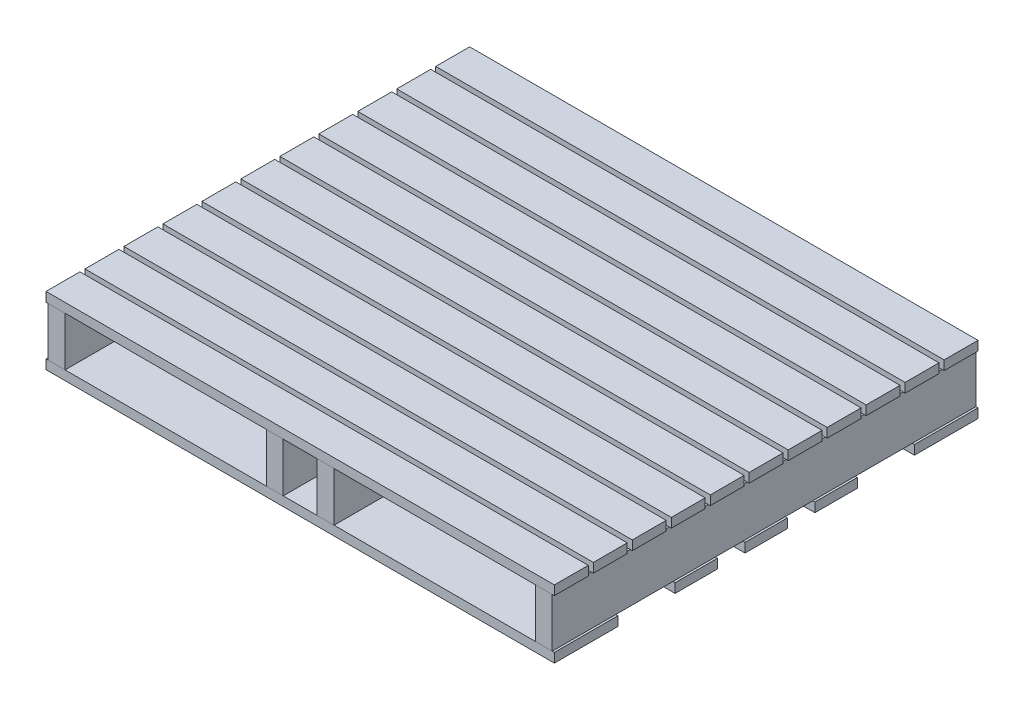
ISO-10303-21;
HEADER;
FILE_DESCRIPTION(('STEP AP214'),'2;1');
FILE_NAME('part.step','',(''),(''),'','','');
FILE_SCHEMA(('AUTOMOTIVE_DESIGN { 1 0 10303 214 1 1 1 1 }'));
ENDSEC;
DATA;
#1=APPLICATION_CONTEXT('core data for automotive mechanical design processes');
#2=APPLICATION_PROTOCOL_DEFINITION('international standard','automotive_design',2000,#1);
#3=PRODUCT_CONTEXT('',#1,'mechanical');
#4=PRODUCT('Part','Part','',(#3));
#5=PRODUCT_RELATED_PRODUCT_CATEGORY('part','',(#4));
#6=PRODUCT_DEFINITION_FORMATION('','',#4);
#7=PRODUCT_DEFINITION_CONTEXT('part definition',#1,'design');
#8=PRODUCT_DEFINITION('design','',#6,#7);
#9=PRODUCT_DEFINITION_SHAPE('','',#8);
#10=(LENGTH_UNIT() NAMED_UNIT(*) SI_UNIT(.MILLI.,.METRE.));
#11=(NAMED_UNIT(*) PLANE_ANGLE_UNIT() SI_UNIT($,.RADIAN.));
#12=(NAMED_UNIT(*) SI_UNIT($,.STERADIAN.) SOLID_ANGLE_UNIT());
#13=UNCERTAINTY_MEASURE_WITH_UNIT(LENGTH_MEASURE(1.E-05),#10,'distance_accuracy_value','');
#14=(GEOMETRIC_REPRESENTATION_CONTEXT(3) GLOBAL_UNCERTAINTY_ASSIGNED_CONTEXT((#13)) GLOBAL_UNIT_ASSIGNED_CONTEXT((#10,
#11,#12)) REPRESENTATION_CONTEXT('',''));
#15=CARTESIAN_POINT('',(0.,0.,0.));
#16=DIRECTION('',(0.,0.,1.));
#17=DIRECTION('',(1.,0.,0.));
#18=AXIS2_PLACEMENT_3D('',#15,#16,#17);
#19=CARTESIAN_POINT('',(-600.,160.,-328.));
#20=DIRECTION('',(1.,0.,0.));
#21=DIRECTION('',(0.,0.,-1.));
#22=AXIS2_PLACEMENT_3D('',#19,#20,#21);
#23=PLANE('',#22);
#24=DIRECTION('',(0.,0.,1.));
#25=VECTOR('',#24,1.);
#26=CARTESIAN_POINT('',(-600.,138.,-328.));
#27=LINE('',#26,#25);
#28=CARTESIAN_POINT('',(-600.,138.,-408.));
#29=VERTEX_POINT('',#28);
#30=CARTESIAN_POINT('',(-600.,138.,-328.));
#31=VERTEX_POINT('',#30);
#32=EDGE_CURVE('E109',#29,#31,#27,.T.);
#33=ORIENTED_EDGE('',*,*,#32,.T.);
#34=DIRECTION('',(0.,-1.,0.));
#35=VECTOR('',#34,1.);
#36=CARTESIAN_POINT('',(-600.,160.,-328.));
#37=LINE('',#36,#35);
#38=CARTESIAN_POINT('',(-600.,160.,-328.));
#39=VERTEX_POINT('',#38);
#40=EDGE_CURVE('E12',#39,#31,#37,.T.);
#41=ORIENTED_EDGE('',*,*,#40,.F.);
#42=DIRECTION('',(0.,0.,1.));
#43=VECTOR('',#42,1.);
#44=CARTESIAN_POINT('',(-600.,160.,-328.));
#45=LINE('',#44,#43);
#46=CARTESIAN_POINT('',(-600.,160.,-408.));
#47=VERTEX_POINT('',#46);
#48=EDGE_CURVE('E97',#47,#39,#45,.T.);
#49=ORIENTED_EDGE('',*,*,#48,.F.);
#50=DIRECTION('',(0.,-1.,0.));
#51=VECTOR('',#50,1.);
#52=CARTESIAN_POINT('',(-600.,160.,-408.));
#53=LINE('',#52,#51);
#54=EDGE_CURVE('E105',#47,#29,#53,.T.);
#55=ORIENTED_EDGE('',*,*,#54,.T.);
#56=EDGE_LOOP('',(#33,#41,#49,#55));
#57=FACE_BOUND('',#56,.T.);
#58=ADVANCED_FACE('F46',(#57),#23,.F.);
#59=CARTESIAN_POINT('',(-600.,160.,-328.));
#60=DIRECTION('',(0.,0.,-1.));
#61=DIRECTION('',(-1.,0.,0.));
#62=AXIS2_PLACEMENT_3D('',#59,#60,#61);
#63=PLANE('',#62);
#64=DIRECTION('',(1.,0.,0.));
#65=VECTOR('',#64,1.);
#66=CARTESIAN_POINT('',(-600.,138.,-328.));
#67=LINE('',#66,#65);
#68=CARTESIAN_POINT('',(600.,138.,-328.));
#69=VERTEX_POINT('',#68);
#70=EDGE_CURVE('E101',#31,#69,#67,.T.);
#71=ORIENTED_EDGE('',*,*,#70,.T.);
#72=DIRECTION('',(0.,-1.,0.));
#73=VECTOR('',#72,1.);
#74=CARTESIAN_POINT('',(600.,160.,-328.));
#75=LINE('',#74,#73);
#76=CARTESIAN_POINT('',(600.,160.,-328.));
#77=VERTEX_POINT('',#76);
#78=EDGE_CURVE('E54',#77,#69,#75,.T.);
#79=ORIENTED_EDGE('',*,*,#78,.F.);
#80=DIRECTION('',(1.,0.,0.));
#81=VECTOR('',#80,1.);
#82=CARTESIAN_POINT('',(-600.,160.,-328.));
#83=LINE('',#82,#81);
#84=EDGE_CURVE('E92',#39,#77,#83,.T.);
#85=ORIENTED_EDGE('',*,*,#84,.F.);
#86=ORIENTED_EDGE('',*,*,#40,.T.);
#87=EDGE_LOOP('',(#71,#79,#85,#86));
#88=FACE_BOUND('',#87,.T.);
#89=ADVANCED_FACE('F100',(#88),#63,.F.);
#90=CARTESIAN_POINT('',(600.,160.,-328.));
#91=DIRECTION('',(-1.,0.,0.));
#92=DIRECTION('',(0.,0.,1.));
#93=AXIS2_PLACEMENT_3D('',#90,#91,#92);
#94=PLANE('',#93);
#95=DIRECTION('',(0.,0.,-1.));
#96=VECTOR('',#95,1.);
#97=CARTESIAN_POINT('',(600.,138.,-328.));
#98=LINE('',#97,#96);
#99=CARTESIAN_POINT('',(600.,138.,-408.));
#100=VERTEX_POINT('',#99);
#101=EDGE_CURVE('E79',#69,#100,#98,.T.);
#102=ORIENTED_EDGE('',*,*,#101,.T.);
#103=DIRECTION('',(0.,-1.,0.));
#104=VECTOR('',#103,1.);
#105=CARTESIAN_POINT('',(600.,160.,-408.));
#106=LINE('',#105,#104);
#107=CARTESIAN_POINT('',(600.,160.,-408.));
#108=VERTEX_POINT('',#107);
#109=EDGE_CURVE('E102',#108,#100,#106,.T.);
#110=ORIENTED_EDGE('',*,*,#109,.F.);
#111=DIRECTION('',(0.,0.,-1.));
#112=VECTOR('',#111,1.);
#113=CARTESIAN_POINT('',(600.,160.,-328.));
#114=LINE('',#113,#112);
#115=EDGE_CURVE('E95',#77,#108,#114,.T.);
#116=ORIENTED_EDGE('',*,*,#115,.F.);
#117=ORIENTED_EDGE('',*,*,#78,.T.);
#118=EDGE_LOOP('',(#102,#110,#116,#117));
#119=FACE_BOUND('',#118,.T.);
#120=ADVANCED_FACE('F103',(#119),#94,.F.);
#121=CARTESIAN_POINT('',(-600.,160.,-408.));
#122=DIRECTION('',(0.,0.,1.));
#123=DIRECTION('',(1.,0.,0.));
#124=AXIS2_PLACEMENT_3D('',#121,#122,#123);
#125=PLANE('',#124);
#126=DIRECTION('',(-1.,0.,0.));
#127=VECTOR('',#126,1.);
#128=CARTESIAN_POINT('',(-600.,138.,-408.));
#129=LINE('',#128,#127);
#130=EDGE_CURVE('E85',#100,#29,#129,.T.);
#131=ORIENTED_EDGE('',*,*,#130,.T.);
#132=ORIENTED_EDGE('',*,*,#54,.F.);
#133=DIRECTION('',(-1.,0.,0.));
#134=VECTOR('',#133,1.);
#135=CARTESIAN_POINT('',(-600.,160.,-408.));
#136=LINE('',#135,#134);
#137=EDGE_CURVE('E62',#108,#47,#136,.T.);
#138=ORIENTED_EDGE('',*,*,#137,.F.);
#139=ORIENTED_EDGE('',*,*,#109,.T.);
#140=EDGE_LOOP('',(#131,#132,#138,#139));
#141=FACE_BOUND('',#140,.T.);
#142=ADVANCED_FACE('F116',(#141),#125,.F.);
#143=CARTESIAN_POINT('',(-600.,160.,-408.));
#144=DIRECTION('',(0.,-1.,0.));
#145=DIRECTION('',(0.,0.,-1.));
#146=AXIS2_PLACEMENT_3D('',#143,#144,#145);
#147=PLANE('',#146);
#148=ORIENTED_EDGE('',*,*,#48,.T.);
#149=ORIENTED_EDGE('',*,*,#84,.T.);
#150=ORIENTED_EDGE('',*,*,#115,.T.);
#151=ORIENTED_EDGE('',*,*,#137,.T.);
#152=EDGE_LOOP('',(#148,#149,#150,#151));
#153=FACE_BOUND('',#152,.T.);
#154=ADVANCED_FACE('F93',(#153),#147,.F.);
#155=CARTESIAN_POINT('',(-600.,138.,-408.));
#156=DIRECTION('',(0.,-1.,0.));
#157=DIRECTION('',(0.,0.,-1.));
#158=AXIS2_PLACEMENT_3D('',#155,#156,#157);
#159=PLANE('',#158);
#160=ORIENTED_EDGE('',*,*,#32,.F.);
#161=ORIENTED_EDGE('',*,*,#130,.F.);
#162=ORIENTED_EDGE('',*,*,#101,.F.);
#163=ORIENTED_EDGE('',*,*,#70,.F.);
#164=EDGE_LOOP('',(#160,#161,#162,#163));
#165=FACE_BOUND('',#164,.T.);
#166=ADVANCED_FACE('F119',(#165),#159,.T.);
#167=CLOSED_SHELL('',(#58,#89,#120,#142,#154,#166));
#168=MANIFOLD_SOLID_BREP('B2',#167);
#169=CARTESIAN_POINT('',(-600.,160.,-236.));
#170=DIRECTION('',(1.,0.,0.));
#171=DIRECTION('',(0.,0.,-1.));
#172=AXIS2_PLACEMENT_3D('',#169,#170,#171);
#173=PLANE('',#172);
#174=DIRECTION('',(0.,0.,1.));
#175=VECTOR('',#174,1.);
#176=CARTESIAN_POINT('',(-600.,138.,-236.));
#177=LINE('',#176,#175);
#178=CARTESIAN_POINT('',(-600.,138.,-316.));
#179=VERTEX_POINT('',#178);
#180=CARTESIAN_POINT('',(-600.,138.,-236.));
#181=VERTEX_POINT('',#180);
#182=EDGE_CURVE('E243',#179,#181,#177,.T.);
#183=ORIENTED_EDGE('',*,*,#182,.T.);
#184=DIRECTION('',(0.,-1.,0.));
#185=VECTOR('',#184,1.);
#186=CARTESIAN_POINT('',(-600.,160.,-236.));
#187=LINE('',#186,#185);
#188=CARTESIAN_POINT('',(-600.,160.,-236.));
#189=VERTEX_POINT('',#188);
#190=EDGE_CURVE('E44',#189,#181,#187,.T.);
#191=ORIENTED_EDGE('',*,*,#190,.F.);
#192=DIRECTION('',(0.,0.,1.));
#193=VECTOR('',#192,1.);
#194=CARTESIAN_POINT('',(-600.,160.,-236.));
#195=LINE('',#194,#193);
#196=CARTESIAN_POINT('',(-600.,160.,-316.));
#197=VERTEX_POINT('',#196);
#198=EDGE_CURVE('E231',#197,#189,#195,.T.);
#199=ORIENTED_EDGE('',*,*,#198,.F.);
#200=DIRECTION('',(0.,-1.,0.));
#201=VECTOR('',#200,1.);
#202=CARTESIAN_POINT('',(-600.,160.,-316.));
#203=LINE('',#202,#201);
#204=EDGE_CURVE('E239',#197,#179,#203,.T.);
#205=ORIENTED_EDGE('',*,*,#204,.T.);
#206=EDGE_LOOP('',(#183,#191,#199,#205));
#207=FACE_BOUND('',#206,.T.);
#208=ADVANCED_FACE('F180',(#207),#173,.F.);
#209=CARTESIAN_POINT('',(-600.,160.,-236.));
#210=DIRECTION('',(0.,0.,-1.));
#211=DIRECTION('',(-1.,0.,0.));
#212=AXIS2_PLACEMENT_3D('',#209,#210,#211);
#213=PLANE('',#212);
#214=DIRECTION('',(1.,0.,0.));
#215=VECTOR('',#214,1.);
#216=CARTESIAN_POINT('',(-600.,138.,-236.));
#217=LINE('',#216,#215);
#218=CARTESIAN_POINT('',(600.,138.,-236.));
#219=VERTEX_POINT('',#218);
#220=EDGE_CURVE('E235',#181,#219,#217,.T.);
#221=ORIENTED_EDGE('',*,*,#220,.T.);
#222=DIRECTION('',(0.,-1.,0.));
#223=VECTOR('',#222,1.);
#224=CARTESIAN_POINT('',(600.,160.,-236.));
#225=LINE('',#224,#223);
#226=CARTESIAN_POINT('',(600.,160.,-236.));
#227=VERTEX_POINT('',#226);
#228=EDGE_CURVE('E188',#227,#219,#225,.T.);
#229=ORIENTED_EDGE('',*,*,#228,.F.);
#230=DIRECTION('',(1.,0.,0.));
#231=VECTOR('',#230,1.);
#232=CARTESIAN_POINT('',(-600.,160.,-236.));
#233=LINE('',#232,#231);
#234=EDGE_CURVE('E226',#189,#227,#233,.T.);
#235=ORIENTED_EDGE('',*,*,#234,.F.);
#236=ORIENTED_EDGE('',*,*,#190,.T.);
#237=EDGE_LOOP('',(#221,#229,#235,#236));
#238=FACE_BOUND('',#237,.T.);
#239=ADVANCED_FACE('F234',(#238),#213,.F.);
#240=CARTESIAN_POINT('',(600.,160.,-236.));
#241=DIRECTION('',(-1.,0.,0.));
#242=DIRECTION('',(0.,0.,1.));
#243=AXIS2_PLACEMENT_3D('',#240,#241,#242);
#244=PLANE('',#243);
#245=DIRECTION('',(0.,0.,-1.));
#246=VECTOR('',#245,1.);
#247=CARTESIAN_POINT('',(600.,138.,-236.));
#248=LINE('',#247,#246);
#249=CARTESIAN_POINT('',(600.,138.,-316.));
#250=VERTEX_POINT('',#249);
#251=EDGE_CURVE('E213',#219,#250,#248,.T.);
#252=ORIENTED_EDGE('',*,*,#251,.T.);
#253=DIRECTION('',(0.,-1.,0.));
#254=VECTOR('',#253,1.);
#255=CARTESIAN_POINT('',(600.,160.,-316.));
#256=LINE('',#255,#254);
#257=CARTESIAN_POINT('',(600.,160.,-316.));
#258=VERTEX_POINT('',#257);
#259=EDGE_CURVE('E236',#258,#250,#256,.T.);
#260=ORIENTED_EDGE('',*,*,#259,.F.);
#261=DIRECTION('',(0.,0.,-1.));
#262=VECTOR('',#261,1.);
#263=CARTESIAN_POINT('',(600.,160.,-236.));
#264=LINE('',#263,#262);
#265=EDGE_CURVE('E229',#227,#258,#264,.T.);
#266=ORIENTED_EDGE('',*,*,#265,.F.);
#267=ORIENTED_EDGE('',*,*,#228,.T.);
#268=EDGE_LOOP('',(#252,#260,#266,#267));
#269=FACE_BOUND('',#268,.T.);
#270=ADVANCED_FACE('F237',(#269),#244,.F.);
#271=CARTESIAN_POINT('',(-600.,160.,-316.));
#272=DIRECTION('',(0.,0.,1.));
#273=DIRECTION('',(1.,0.,0.));
#274=AXIS2_PLACEMENT_3D('',#271,#272,#273);
#275=PLANE('',#274);
#276=DIRECTION('',(-1.,0.,0.));
#277=VECTOR('',#276,1.);
#278=CARTESIAN_POINT('',(-600.,138.,-316.));
#279=LINE('',#278,#277);
#280=EDGE_CURVE('E219',#250,#179,#279,.T.);
#281=ORIENTED_EDGE('',*,*,#280,.T.);
#282=ORIENTED_EDGE('',*,*,#204,.F.);
#283=DIRECTION('',(-1.,0.,0.));
#284=VECTOR('',#283,1.);
#285=CARTESIAN_POINT('',(-600.,160.,-316.));
#286=LINE('',#285,#284);
#287=EDGE_CURVE('E196',#258,#197,#286,.T.);
#288=ORIENTED_EDGE('',*,*,#287,.F.);
#289=ORIENTED_EDGE('',*,*,#259,.T.);
#290=EDGE_LOOP('',(#281,#282,#288,#289));
#291=FACE_BOUND('',#290,.T.);
#292=ADVANCED_FACE('F250',(#291),#275,.F.);
#293=CARTESIAN_POINT('',(-600.,160.,-316.));
#294=DIRECTION('',(0.,-1.,0.));
#295=DIRECTION('',(0.,0.,-1.));
#296=AXIS2_PLACEMENT_3D('',#293,#294,#295);
#297=PLANE('',#296);
#298=ORIENTED_EDGE('',*,*,#198,.T.);
#299=ORIENTED_EDGE('',*,*,#234,.T.);
#300=ORIENTED_EDGE('',*,*,#265,.T.);
#301=ORIENTED_EDGE('',*,*,#287,.T.);
#302=EDGE_LOOP('',(#298,#299,#300,#301));
#303=FACE_BOUND('',#302,.T.);
#304=ADVANCED_FACE('F227',(#303),#297,.F.);
#305=CARTESIAN_POINT('',(-600.,138.,-316.));
#306=DIRECTION('',(0.,-1.,0.));
#307=DIRECTION('',(0.,0.,-1.));
#308=AXIS2_PLACEMENT_3D('',#305,#306,#307);
#309=PLANE('',#308);
#310=ORIENTED_EDGE('',*,*,#182,.F.);
#311=ORIENTED_EDGE('',*,*,#280,.F.);
#312=ORIENTED_EDGE('',*,*,#251,.F.);
#313=ORIENTED_EDGE('',*,*,#220,.F.);
#314=EDGE_LOOP('',(#310,#311,#312,#313));
#315=FACE_BOUND('',#314,.T.);
#316=ADVANCED_FACE('F253',(#315),#309,.T.);
#317=CLOSED_SHELL('',(#208,#239,#270,#292,#304,#316));
#318=MANIFOLD_SOLID_BREP('B6',#317);
#319=CARTESIAN_POINT('',(-600.,160.,-144.));
#320=DIRECTION('',(1.,0.,0.));
#321=DIRECTION('',(0.,0.,-1.));
#322=AXIS2_PLACEMENT_3D('',#319,#320,#321);
#323=PLANE('',#322);
#324=DIRECTION('',(0.,0.,1.));
#325=VECTOR('',#324,1.);
#326=CARTESIAN_POINT('',(-600.,138.,-144.));
#327=LINE('',#326,#325);
#328=CARTESIAN_POINT('',(-600.,138.,-224.));
#329=VERTEX_POINT('',#328);
#330=CARTESIAN_POINT('',(-600.,138.,-144.));
#331=VERTEX_POINT('',#330);
#332=EDGE_CURVE('E377',#329,#331,#327,.T.);
#333=ORIENTED_EDGE('',*,*,#332,.T.);
#334=DIRECTION('',(0.,-1.,0.));
#335=VECTOR('',#334,1.);
#336=CARTESIAN_POINT('',(-600.,160.,-144.));
#337=LINE('',#336,#335);
#338=CARTESIAN_POINT('',(-600.,160.,-144.));
#339=VERTEX_POINT('',#338);
#340=EDGE_CURVE('E178',#339,#331,#337,.T.);
#341=ORIENTED_EDGE('',*,*,#340,.F.);
#342=DIRECTION('',(0.,0.,1.));
#343=VECTOR('',#342,1.);
#344=CARTESIAN_POINT('',(-600.,160.,-144.));
#345=LINE('',#344,#343);
#346=CARTESIAN_POINT('',(-600.,160.,-224.));
#347=VERTEX_POINT('',#346);
#348=EDGE_CURVE('E365',#347,#339,#345,.T.);
#349=ORIENTED_EDGE('',*,*,#348,.F.);
#350=DIRECTION('',(0.,-1.,0.));
#351=VECTOR('',#350,1.);
#352=CARTESIAN_POINT('',(-600.,160.,-224.));
#353=LINE('',#352,#351);
#354=EDGE_CURVE('E373',#347,#329,#353,.T.);
#355=ORIENTED_EDGE('',*,*,#354,.T.);
#356=EDGE_LOOP('',(#333,#341,#349,#355));
#357=FACE_BOUND('',#356,.T.);
#358=ADVANCED_FACE('F314',(#357),#323,.F.);
#359=CARTESIAN_POINT('',(-600.,160.,-144.));
#360=DIRECTION('',(0.,0.,-1.));
#361=DIRECTION('',(-1.,0.,0.));
#362=AXIS2_PLACEMENT_3D('',#359,#360,#361);
#363=PLANE('',#362);
#364=DIRECTION('',(1.,0.,0.));
#365=VECTOR('',#364,1.);
#366=CARTESIAN_POINT('',(-600.,138.,-144.));
#367=LINE('',#366,#365);
#368=CARTESIAN_POINT('',(600.,138.,-144.));
#369=VERTEX_POINT('',#368);
#370=EDGE_CURVE('E369',#331,#369,#367,.T.);
#371=ORIENTED_EDGE('',*,*,#370,.T.);
#372=DIRECTION('',(0.,-1.,0.));
#373=VECTOR('',#372,1.);
#374=CARTESIAN_POINT('',(600.,160.,-144.));
#375=LINE('',#374,#373);
#376=CARTESIAN_POINT('',(600.,160.,-144.));
#377=VERTEX_POINT('',#376);
#378=EDGE_CURVE('E322',#377,#369,#375,.T.);
#379=ORIENTED_EDGE('',*,*,#378,.F.);
#380=DIRECTION('',(1.,0.,0.));
#381=VECTOR('',#380,1.);
#382=CARTESIAN_POINT('',(-600.,160.,-144.));
#383=LINE('',#382,#381);
#384=EDGE_CURVE('E360',#339,#377,#383,.T.);
#385=ORIENTED_EDGE('',*,*,#384,.F.);
#386=ORIENTED_EDGE('',*,*,#340,.T.);
#387=EDGE_LOOP('',(#371,#379,#385,#386));
#388=FACE_BOUND('',#387,.T.);
#389=ADVANCED_FACE('F368',(#388),#363,.F.);
#390=CARTESIAN_POINT('',(600.,160.,-144.));
#391=DIRECTION('',(-1.,0.,0.));
#392=DIRECTION('',(0.,0.,1.));
#393=AXIS2_PLACEMENT_3D('',#390,#391,#392);
#394=PLANE('',#393);
#395=DIRECTION('',(0.,0.,-1.));
#396=VECTOR('',#395,1.);
#397=CARTESIAN_POINT('',(600.,138.,-144.));
#398=LINE('',#397,#396);
#399=CARTESIAN_POINT('',(600.,138.,-224.));
#400=VERTEX_POINT('',#399);
#401=EDGE_CURVE('E347',#369,#400,#398,.T.);
#402=ORIENTED_EDGE('',*,*,#401,.T.);
#403=DIRECTION('',(0.,-1.,0.));
#404=VECTOR('',#403,1.);
#405=CARTESIAN_POINT('',(600.,160.,-224.));
#406=LINE('',#405,#404);
#407=CARTESIAN_POINT('',(600.,160.,-224.));
#408=VERTEX_POINT('',#407);
#409=EDGE_CURVE('E370',#408,#400,#406,.T.);
#410=ORIENTED_EDGE('',*,*,#409,.F.);
#411=DIRECTION('',(0.,0.,-1.));
#412=VECTOR('',#411,1.);
#413=CARTESIAN_POINT('',(600.,160.,-144.));
#414=LINE('',#413,#412);
#415=EDGE_CURVE('E363',#377,#408,#414,.T.);
#416=ORIENTED_EDGE('',*,*,#415,.F.);
#417=ORIENTED_EDGE('',*,*,#378,.T.);
#418=EDGE_LOOP('',(#402,#410,#416,#417));
#419=FACE_BOUND('',#418,.T.);
#420=ADVANCED_FACE('F371',(#419),#394,.F.);
#421=CARTESIAN_POINT('',(-600.,160.,-224.));
#422=DIRECTION('',(0.,0.,1.));
#423=DIRECTION('',(1.,0.,0.));
#424=AXIS2_PLACEMENT_3D('',#421,#422,#423);
#425=PLANE('',#424);
#426=DIRECTION('',(-1.,0.,0.));
#427=VECTOR('',#426,1.);
#428=CARTESIAN_POINT('',(-600.,138.,-224.));
#429=LINE('',#428,#427);
#430=EDGE_CURVE('E353',#400,#329,#429,.T.);
#431=ORIENTED_EDGE('',*,*,#430,.T.);
#432=ORIENTED_EDGE('',*,*,#354,.F.);
#433=DIRECTION('',(-1.,0.,0.));
#434=VECTOR('',#433,1.);
#435=CARTESIAN_POINT('',(-600.,160.,-224.));
#436=LINE('',#435,#434);
#437=EDGE_CURVE('E330',#408,#347,#436,.T.);
#438=ORIENTED_EDGE('',*,*,#437,.F.);
#439=ORIENTED_EDGE('',*,*,#409,.T.);
#440=EDGE_LOOP('',(#431,#432,#438,#439));
#441=FACE_BOUND('',#440,.T.);
#442=ADVANCED_FACE('F384',(#441),#425,.F.);
#443=CARTESIAN_POINT('',(-600.,160.,-224.));
#444=DIRECTION('',(0.,-1.,0.));
#445=DIRECTION('',(0.,0.,-1.));
#446=AXIS2_PLACEMENT_3D('',#443,#444,#445);
#447=PLANE('',#446);
#448=ORIENTED_EDGE('',*,*,#348,.T.);
#449=ORIENTED_EDGE('',*,*,#384,.T.);
#450=ORIENTED_EDGE('',*,*,#415,.T.);
#451=ORIENTED_EDGE('',*,*,#437,.T.);
#452=EDGE_LOOP('',(#448,#449,#450,#451));
#453=FACE_BOUND('',#452,.T.);
#454=ADVANCED_FACE('F361',(#453),#447,.F.);
#455=CARTESIAN_POINT('',(-600.,138.,-224.));
#456=DIRECTION('',(0.,-1.,0.));
#457=DIRECTION('',(0.,0.,-1.));
#458=AXIS2_PLACEMENT_3D('',#455,#456,#457);
#459=PLANE('',#458);
#460=ORIENTED_EDGE('',*,*,#332,.F.);
#461=ORIENTED_EDGE('',*,*,#430,.F.);
#462=ORIENTED_EDGE('',*,*,#401,.F.);
#463=ORIENTED_EDGE('',*,*,#370,.F.);
#464=EDGE_LOOP('',(#460,#461,#462,#463));
#465=FACE_BOUND('',#464,.T.);
#466=ADVANCED_FACE('F387',(#465),#459,.T.);
#467=CLOSED_SHELL('',(#358,#389,#420,#442,#454,#466));
#468=MANIFOLD_SOLID_BREP('B38',#467);
#469=CARTESIAN_POINT('',(-600.,160.,-52.));
#470=DIRECTION('',(1.,0.,0.));
#471=DIRECTION('',(0.,0.,-1.));
#472=AXIS2_PLACEMENT_3D('',#469,#470,#471);
#473=PLANE('',#472);
#474=DIRECTION('',(0.,0.,1.));
#475=VECTOR('',#474,1.);
#476=CARTESIAN_POINT('',(-600.,138.,-52.));
#477=LINE('',#476,#475);
#478=CARTESIAN_POINT('',(-600.,138.,-132.));
#479=VERTEX_POINT('',#478);
#480=CARTESIAN_POINT('',(-600.,138.,-52.));
#481=VERTEX_POINT('',#480);
#482=EDGE_CURVE('E511',#479,#481,#477,.T.);
#483=ORIENTED_EDGE('',*,*,#482,.T.);
#484=DIRECTION('',(0.,-1.,0.));
#485=VECTOR('',#484,1.);
#486=CARTESIAN_POINT('',(-600.,160.,-52.));
#487=LINE('',#486,#485);
#488=CARTESIAN_POINT('',(-600.,160.,-52.));
#489=VERTEX_POINT('',#488);
#490=EDGE_CURVE('E312',#489,#481,#487,.T.);
#491=ORIENTED_EDGE('',*,*,#490,.F.);
#492=DIRECTION('',(0.,0.,1.));
#493=VECTOR('',#492,1.);
#494=CARTESIAN_POINT('',(-600.,160.,-52.));
#495=LINE('',#494,#493);
#496=CARTESIAN_POINT('',(-600.,160.,-132.));
#497=VERTEX_POINT('',#496);
#498=EDGE_CURVE('E499',#497,#489,#495,.T.);
#499=ORIENTED_EDGE('',*,*,#498,.F.);
#500=DIRECTION('',(0.,-1.,0.));
#501=VECTOR('',#500,1.);
#502=CARTESIAN_POINT('',(-600.,160.,-132.));
#503=LINE('',#502,#501);
#504=EDGE_CURVE('E507',#497,#479,#503,.T.);
#505=ORIENTED_EDGE('',*,*,#504,.T.);
#506=EDGE_LOOP('',(#483,#491,#499,#505));
#507=FACE_BOUND('',#506,.T.);
#508=ADVANCED_FACE('F448',(#507),#473,.F.);
#509=CARTESIAN_POINT('',(-600.,160.,-52.));
#510=DIRECTION('',(0.,0.,-1.));
#511=DIRECTION('',(-1.,0.,0.));
#512=AXIS2_PLACEMENT_3D('',#509,#510,#511);
#513=PLANE('',#512);
#514=DIRECTION('',(1.,0.,0.));
#515=VECTOR('',#514,1.);
#516=CARTESIAN_POINT('',(-600.,138.,-52.));
#517=LINE('',#516,#515);
#518=CARTESIAN_POINT('',(600.,138.,-52.));
#519=VERTEX_POINT('',#518);
#520=EDGE_CURVE('E503',#481,#519,#517,.T.);
#521=ORIENTED_EDGE('',*,*,#520,.T.);
#522=DIRECTION('',(0.,-1.,0.));
#523=VECTOR('',#522,1.);
#524=CARTESIAN_POINT('',(600.,160.,-52.));
#525=LINE('',#524,#523);
#526=CARTESIAN_POINT('',(600.,160.,-52.));
#527=VERTEX_POINT('',#526);
#528=EDGE_CURVE('E456',#527,#519,#525,.T.);
#529=ORIENTED_EDGE('',*,*,#528,.F.);
#530=DIRECTION('',(1.,0.,0.));
#531=VECTOR('',#530,1.);
#532=CARTESIAN_POINT('',(-600.,160.,-52.));
#533=LINE('',#532,#531);
#534=EDGE_CURVE('E494',#489,#527,#533,.T.);
#535=ORIENTED_EDGE('',*,*,#534,.F.);
#536=ORIENTED_EDGE('',*,*,#490,.T.);
#537=EDGE_LOOP('',(#521,#529,#535,#536));
#538=FACE_BOUND('',#537,.T.);
#539=ADVANCED_FACE('F502',(#538),#513,.F.);
#540=CARTESIAN_POINT('',(600.,160.,-52.));
#541=DIRECTION('',(-1.,0.,0.));
#542=DIRECTION('',(0.,0.,1.));
#543=AXIS2_PLACEMENT_3D('',#540,#541,#542);
#544=PLANE('',#543);
#545=DIRECTION('',(0.,0.,-1.));
#546=VECTOR('',#545,1.);
#547=CARTESIAN_POINT('',(600.,138.,-52.));
#548=LINE('',#547,#546);
#549=CARTESIAN_POINT('',(600.,138.,-132.));
#550=VERTEX_POINT('',#549);
#551=EDGE_CURVE('E481',#519,#550,#548,.T.);
#552=ORIENTED_EDGE('',*,*,#551,.T.);
#553=DIRECTION('',(0.,-1.,0.));
#554=VECTOR('',#553,1.);
#555=CARTESIAN_POINT('',(600.,160.,-132.));
#556=LINE('',#555,#554);
#557=CARTESIAN_POINT('',(600.,160.,-132.));
#558=VERTEX_POINT('',#557);
#559=EDGE_CURVE('E504',#558,#550,#556,.T.);
#560=ORIENTED_EDGE('',*,*,#559,.F.);
#561=DIRECTION('',(0.,0.,-1.));
#562=VECTOR('',#561,1.);
#563=CARTESIAN_POINT('',(600.,160.,-52.));
#564=LINE('',#563,#562);
#565=EDGE_CURVE('E497',#527,#558,#564,.T.);
#566=ORIENTED_EDGE('',*,*,#565,.F.);
#567=ORIENTED_EDGE('',*,*,#528,.T.);
#568=EDGE_LOOP('',(#552,#560,#566,#567));
#569=FACE_BOUND('',#568,.T.);
#570=ADVANCED_FACE('F505',(#569),#544,.F.);
#571=CARTESIAN_POINT('',(-600.,160.,-132.));
#572=DIRECTION('',(0.,0.,1.));
#573=DIRECTION('',(1.,0.,0.));
#574=AXIS2_PLACEMENT_3D('',#571,#572,#573);
#575=PLANE('',#574);
#576=DIRECTION('',(-1.,0.,0.));
#577=VECTOR('',#576,1.);
#578=CARTESIAN_POINT('',(-600.,138.,-132.));
#579=LINE('',#578,#577);
#580=EDGE_CURVE('E487',#550,#479,#579,.T.);
#581=ORIENTED_EDGE('',*,*,#580,.T.);
#582=ORIENTED_EDGE('',*,*,#504,.F.);
#583=DIRECTION('',(-1.,0.,0.));
#584=VECTOR('',#583,1.);
#585=CARTESIAN_POINT('',(-600.,160.,-132.));
#586=LINE('',#585,#584);
#587=EDGE_CURVE('E464',#558,#497,#586,.T.);
#588=ORIENTED_EDGE('',*,*,#587,.F.);
#589=ORIENTED_EDGE('',*,*,#559,.T.);
#590=EDGE_LOOP('',(#581,#582,#588,#589));
#591=FACE_BOUND('',#590,.T.);
#592=ADVANCED_FACE('F518',(#591),#575,.F.);
#593=CARTESIAN_POINT('',(-600.,160.,-132.));
#594=DIRECTION('',(0.,-1.,0.));
#595=DIRECTION('',(0.,0.,-1.));
#596=AXIS2_PLACEMENT_3D('',#593,#594,#595);
#597=PLANE('',#596);
#598=ORIENTED_EDGE('',*,*,#498,.T.);
#599=ORIENTED_EDGE('',*,*,#534,.T.);
#600=ORIENTED_EDGE('',*,*,#565,.T.);
#601=ORIENTED_EDGE('',*,*,#587,.T.);
#602=EDGE_LOOP('',(#598,#599,#600,#601));
#603=FACE_BOUND('',#602,.T.);
#604=ADVANCED_FACE('F495',(#603),#597,.F.);
#605=CARTESIAN_POINT('',(-600.,138.,-132.));
#606=DIRECTION('',(0.,-1.,0.));
#607=DIRECTION('',(0.,0.,-1.));
#608=AXIS2_PLACEMENT_3D('',#605,#606,#607);
#609=PLANE('',#608);
#610=ORIENTED_EDGE('',*,*,#482,.F.);
#611=ORIENTED_EDGE('',*,*,#580,.F.);
#612=ORIENTED_EDGE('',*,*,#551,.F.);
#613=ORIENTED_EDGE('',*,*,#520,.F.);
#614=EDGE_LOOP('',(#610,#611,#612,#613));
#615=FACE_BOUND('',#614,.T.);
#616=ADVANCED_FACE('F521',(#615),#609,.T.);
#617=CLOSED_SHELL('',(#508,#539,#570,#592,#604,#616));
#618=MANIFOLD_SOLID_BREP('B172',#617);
#619=CARTESIAN_POINT('',(-600.,160.,40.));
#620=DIRECTION('',(1.,0.,0.));
#621=DIRECTION('',(0.,0.,-1.));
#622=AXIS2_PLACEMENT_3D('',#619,#620,#621);
#623=PLANE('',#622);
#624=DIRECTION('',(0.,0.,1.));
#625=VECTOR('',#624,1.);
#626=CARTESIAN_POINT('',(-600.,138.,40.));
#627=LINE('',#626,#625);
#628=CARTESIAN_POINT('',(-600.,138.,-40.));
#629=VERTEX_POINT('',#628);
#630=CARTESIAN_POINT('',(-600.,138.,40.));
#631=VERTEX_POINT('',#630);
#632=EDGE_CURVE('E645',#629,#631,#627,.T.);
#633=ORIENTED_EDGE('',*,*,#632,.T.);
#634=DIRECTION('',(0.,-1.,0.));
#635=VECTOR('',#634,1.);
#636=CARTESIAN_POINT('',(-600.,160.,40.));
#637=LINE('',#636,#635);
#638=CARTESIAN_POINT('',(-600.,160.,40.));
#639=VERTEX_POINT('',#638);
#640=EDGE_CURVE('E446',#639,#631,#637,.T.);
#641=ORIENTED_EDGE('',*,*,#640,.F.);
#642=DIRECTION('',(0.,0.,1.));
#643=VECTOR('',#642,1.);
#644=CARTESIAN_POINT('',(-600.,160.,40.));
#645=LINE('',#644,#643);
#646=CARTESIAN_POINT('',(-600.,160.,-40.));
#647=VERTEX_POINT('',#646);
#648=EDGE_CURVE('E633',#647,#639,#645,.T.);
#649=ORIENTED_EDGE('',*,*,#648,.F.);
#650=DIRECTION('',(0.,-1.,0.));
#651=VECTOR('',#650,1.);
#652=CARTESIAN_POINT('',(-600.,160.,-40.));
#653=LINE('',#652,#651);
#654=EDGE_CURVE('E641',#647,#629,#653,.T.);
#655=ORIENTED_EDGE('',*,*,#654,.T.);
#656=EDGE_LOOP('',(#633,#641,#649,#655));
#657=FACE_BOUND('',#656,.T.);
#658=ADVANCED_FACE('F582',(#657),#623,.F.);
#659=CARTESIAN_POINT('',(-600.,160.,40.));
#660=DIRECTION('',(0.,0.,-1.));
#661=DIRECTION('',(-1.,0.,0.));
#662=AXIS2_PLACEMENT_3D('',#659,#660,#661);
#663=PLANE('',#662);
#664=DIRECTION('',(1.,0.,0.));
#665=VECTOR('',#664,1.);
#666=CARTESIAN_POINT('',(-600.,138.,40.));
#667=LINE('',#666,#665);
#668=CARTESIAN_POINT('',(600.,138.,40.));
#669=VERTEX_POINT('',#668);
#670=EDGE_CURVE('E637',#631,#669,#667,.T.);
#671=ORIENTED_EDGE('',*,*,#670,.T.);
#672=DIRECTION('',(0.,-1.,0.));
#673=VECTOR('',#672,1.);
#674=CARTESIAN_POINT('',(600.,160.,40.));
#675=LINE('',#674,#673);
#676=CARTESIAN_POINT('',(600.,160.,40.));
#677=VERTEX_POINT('',#676);
#678=EDGE_CURVE('E590',#677,#669,#675,.T.);
#679=ORIENTED_EDGE('',*,*,#678,.F.);
#680=DIRECTION('',(1.,0.,0.));
#681=VECTOR('',#680,1.);
#682=CARTESIAN_POINT('',(-600.,160.,40.));
#683=LINE('',#682,#681);
#684=EDGE_CURVE('E628',#639,#677,#683,.T.);
#685=ORIENTED_EDGE('',*,*,#684,.F.);
#686=ORIENTED_EDGE('',*,*,#640,.T.);
#687=EDGE_LOOP('',(#671,#679,#685,#686));
#688=FACE_BOUND('',#687,.T.);
#689=ADVANCED_FACE('F636',(#688),#663,.F.);
#690=CARTESIAN_POINT('',(600.,160.,40.));
#691=DIRECTION('',(-1.,0.,0.));
#692=DIRECTION('',(0.,0.,1.));
#693=AXIS2_PLACEMENT_3D('',#690,#691,#692);
#694=PLANE('',#693);
#695=DIRECTION('',(0.,0.,-1.));
#696=VECTOR('',#695,1.);
#697=CARTESIAN_POINT('',(600.,138.,40.));
#698=LINE('',#697,#696);
#699=CARTESIAN_POINT('',(600.,138.,-40.));
#700=VERTEX_POINT('',#699);
#701=EDGE_CURVE('E615',#669,#700,#698,.T.);
#702=ORIENTED_EDGE('',*,*,#701,.T.);
#703=DIRECTION('',(0.,-1.,0.));
#704=VECTOR('',#703,1.);
#705=CARTESIAN_POINT('',(600.,160.,-40.));
#706=LINE('',#705,#704);
#707=CARTESIAN_POINT('',(600.,160.,-40.));
#708=VERTEX_POINT('',#707);
#709=EDGE_CURVE('E638',#708,#700,#706,.T.);
#710=ORIENTED_EDGE('',*,*,#709,.F.);
#711=DIRECTION('',(0.,0.,-1.));
#712=VECTOR('',#711,1.);
#713=CARTESIAN_POINT('',(600.,160.,40.));
#714=LINE('',#713,#712);
#715=EDGE_CURVE('E631',#677,#708,#714,.T.);
#716=ORIENTED_EDGE('',*,*,#715,.F.);
#717=ORIENTED_EDGE('',*,*,#678,.T.);
#718=EDGE_LOOP('',(#702,#710,#716,#717));
#719=FACE_BOUND('',#718,.T.);
#720=ADVANCED_FACE('F639',(#719),#694,.F.);
#721=CARTESIAN_POINT('',(-600.,160.,-40.));
#722=DIRECTION('',(0.,0.,1.));
#723=DIRECTION('',(1.,0.,0.));
#724=AXIS2_PLACEMENT_3D('',#721,#722,#723);
#725=PLANE('',#724);
#726=DIRECTION('',(-1.,0.,0.));
#727=VECTOR('',#726,1.);
#728=CARTESIAN_POINT('',(-600.,138.,-40.));
#729=LINE('',#728,#727);
#730=EDGE_CURVE('E621',#700,#629,#729,.T.);
#731=ORIENTED_EDGE('',*,*,#730,.T.);
#732=ORIENTED_EDGE('',*,*,#654,.F.);
#733=DIRECTION('',(-1.,0.,0.));
#734=VECTOR('',#733,1.);
#735=CARTESIAN_POINT('',(-600.,160.,-40.));
#736=LINE('',#735,#734);
#737=EDGE_CURVE('E598',#708,#647,#736,.T.);
#738=ORIENTED_EDGE('',*,*,#737,.F.);
#739=ORIENTED_EDGE('',*,*,#709,.T.);
#740=EDGE_LOOP('',(#731,#732,#738,#739));
#741=FACE_BOUND('',#740,.T.);
#742=ADVANCED_FACE('F652',(#741),#725,.F.);
#743=CARTESIAN_POINT('',(-600.,160.,-40.));
#744=DIRECTION('',(0.,-1.,0.));
#745=DIRECTION('',(0.,0.,-1.));
#746=AXIS2_PLACEMENT_3D('',#743,#744,#745);
#747=PLANE('',#746);
#748=ORIENTED_EDGE('',*,*,#648,.T.);
#749=ORIENTED_EDGE('',*,*,#684,.T.);
#750=ORIENTED_EDGE('',*,*,#715,.T.);
#751=ORIENTED_EDGE('',*,*,#737,.T.);
#752=EDGE_LOOP('',(#748,#749,#750,#751));
#753=FACE_BOUND('',#752,.T.);
#754=ADVANCED_FACE('F629',(#753),#747,.F.);
#755=CARTESIAN_POINT('',(-600.,138.,-40.));
#756=DIRECTION('',(0.,-1.,0.));
#757=DIRECTION('',(0.,0.,-1.));
#758=AXIS2_PLACEMENT_3D('',#755,#756,#757);
#759=PLANE('',#758);
#760=ORIENTED_EDGE('',*,*,#632,.F.);
#761=ORIENTED_EDGE('',*,*,#730,.F.);
#762=ORIENTED_EDGE('',*,*,#701,.F.);
#763=ORIENTED_EDGE('',*,*,#670,.F.);
#764=EDGE_LOOP('',(#760,#761,#762,#763));
#765=FACE_BOUND('',#764,.T.);
#766=ADVANCED_FACE('F655',(#765),#759,.T.);
#767=CLOSED_SHELL('',(#658,#689,#720,#742,#754,#766));
#768=MANIFOLD_SOLID_BREP('B306',#767);
#769=CARTESIAN_POINT('',(-600.,160.,132.));
#770=DIRECTION('',(1.,0.,0.));
#771=DIRECTION('',(0.,0.,-1.));
#772=AXIS2_PLACEMENT_3D('',#769,#770,#771);
#773=PLANE('',#772);
#774=DIRECTION('',(0.,0.,1.));
#775=VECTOR('',#774,1.);
#776=CARTESIAN_POINT('',(-600.,138.,132.));
#777=LINE('',#776,#775);
#778=CARTESIAN_POINT('',(-600.,138.,52.));
#779=VERTEX_POINT('',#778);
#780=CARTESIAN_POINT('',(-600.,138.,132.));
#781=VERTEX_POINT('',#780);
#782=EDGE_CURVE('E779',#779,#781,#777,.T.);
#783=ORIENTED_EDGE('',*,*,#782,.T.);
#784=DIRECTION('',(0.,-1.,0.));
#785=VECTOR('',#784,1.);
#786=CARTESIAN_POINT('',(-600.,160.,132.));
#787=LINE('',#786,#785);
#788=CARTESIAN_POINT('',(-600.,160.,132.));
#789=VERTEX_POINT('',#788);
#790=EDGE_CURVE('E580',#789,#781,#787,.T.);
#791=ORIENTED_EDGE('',*,*,#790,.F.);
#792=DIRECTION('',(0.,0.,1.));
#793=VECTOR('',#792,1.);
#794=CARTESIAN_POINT('',(-600.,160.,132.));
#795=LINE('',#794,#793);
#796=CARTESIAN_POINT('',(-600.,160.,52.));
#797=VERTEX_POINT('',#796);
#798=EDGE_CURVE('E767',#797,#789,#795,.T.);
#799=ORIENTED_EDGE('',*,*,#798,.F.);
#800=DIRECTION('',(0.,-1.,0.));
#801=VECTOR('',#800,1.);
#802=CARTESIAN_POINT('',(-600.,160.,52.));
#803=LINE('',#802,#801);
#804=EDGE_CURVE('E775',#797,#779,#803,.T.);
#805=ORIENTED_EDGE('',*,*,#804,.T.);
#806=EDGE_LOOP('',(#783,#791,#799,#805));
#807=FACE_BOUND('',#806,.T.);
#808=ADVANCED_FACE('F716',(#807),#773,.F.);
#809=CARTESIAN_POINT('',(-600.,160.,132.));
#810=DIRECTION('',(0.,0.,-1.));
#811=DIRECTION('',(-1.,0.,0.));
#812=AXIS2_PLACEMENT_3D('',#809,#810,#811);
#813=PLANE('',#812);
#814=DIRECTION('',(1.,0.,0.));
#815=VECTOR('',#814,1.);
#816=CARTESIAN_POINT('',(-600.,138.,132.));
#817=LINE('',#816,#815);
#818=CARTESIAN_POINT('',(600.,138.,132.));
#819=VERTEX_POINT('',#818);
#820=EDGE_CURVE('E771',#781,#819,#817,.T.);
#821=ORIENTED_EDGE('',*,*,#820,.T.);
#822=DIRECTION('',(0.,-1.,0.));
#823=VECTOR('',#822,1.);
#824=CARTESIAN_POINT('',(600.,160.,132.));
#825=LINE('',#824,#823);
#826=CARTESIAN_POINT('',(600.,160.,132.));
#827=VERTEX_POINT('',#826);
#828=EDGE_CURVE('E724',#827,#819,#825,.T.);
#829=ORIENTED_EDGE('',*,*,#828,.F.);
#830=DIRECTION('',(1.,0.,0.));
#831=VECTOR('',#830,1.);
#832=CARTESIAN_POINT('',(-600.,160.,132.));
#833=LINE('',#832,#831);
#834=EDGE_CURVE('E762',#789,#827,#833,.T.);
#835=ORIENTED_EDGE('',*,*,#834,.F.);
#836=ORIENTED_EDGE('',*,*,#790,.T.);
#837=EDGE_LOOP('',(#821,#829,#835,#836));
#838=FACE_BOUND('',#837,.T.);
#839=ADVANCED_FACE('F770',(#838),#813,.F.);
#840=CARTESIAN_POINT('',(600.,160.,132.));
#841=DIRECTION('',(-1.,0.,0.));
#842=DIRECTION('',(0.,0.,1.));
#843=AXIS2_PLACEMENT_3D('',#840,#841,#842);
#844=PLANE('',#843);
#845=DIRECTION('',(0.,0.,-1.));
#846=VECTOR('',#845,1.);
#847=CARTESIAN_POINT('',(600.,138.,132.));
#848=LINE('',#847,#846);
#849=CARTESIAN_POINT('',(600.,138.,52.));
#850=VERTEX_POINT('',#849);
#851=EDGE_CURVE('E749',#819,#850,#848,.T.);
#852=ORIENTED_EDGE('',*,*,#851,.T.);
#853=DIRECTION('',(0.,-1.,0.));
#854=VECTOR('',#853,1.);
#855=CARTESIAN_POINT('',(600.,160.,52.));
#856=LINE('',#855,#854);
#857=CARTESIAN_POINT('',(600.,160.,52.));
#858=VERTEX_POINT('',#857);
#859=EDGE_CURVE('E772',#858,#850,#856,.T.);
#860=ORIENTED_EDGE('',*,*,#859,.F.);
#861=DIRECTION('',(0.,0.,-1.));
#862=VECTOR('',#861,1.);
#863=CARTESIAN_POINT('',(600.,160.,132.));
#864=LINE('',#863,#862);
#865=EDGE_CURVE('E765',#827,#858,#864,.T.);
#866=ORIENTED_EDGE('',*,*,#865,.F.);
#867=ORIENTED_EDGE('',*,*,#828,.T.);
#868=EDGE_LOOP('',(#852,#860,#866,#867));
#869=FACE_BOUND('',#868,.T.);
#870=ADVANCED_FACE('F773',(#869),#844,.F.);
#871=CARTESIAN_POINT('',(-600.,160.,52.));
#872=DIRECTION('',(0.,0.,1.));
#873=DIRECTION('',(1.,0.,0.));
#874=AXIS2_PLACEMENT_3D('',#871,#872,#873);
#875=PLANE('',#874);
#876=DIRECTION('',(-1.,0.,0.));
#877=VECTOR('',#876,1.);
#878=CARTESIAN_POINT('',(-600.,138.,52.));
#879=LINE('',#878,#877);
#880=EDGE_CURVE('E755',#850,#779,#879,.T.);
#881=ORIENTED_EDGE('',*,*,#880,.T.);
#882=ORIENTED_EDGE('',*,*,#804,.F.);
#883=DIRECTION('',(-1.,0.,0.));
#884=VECTOR('',#883,1.);
#885=CARTESIAN_POINT('',(-600.,160.,52.));
#886=LINE('',#885,#884);
#887=EDGE_CURVE('E732',#858,#797,#886,.T.);
#888=ORIENTED_EDGE('',*,*,#887,.F.);
#889=ORIENTED_EDGE('',*,*,#859,.T.);
#890=EDGE_LOOP('',(#881,#882,#888,#889));
#891=FACE_BOUND('',#890,.T.);
#892=ADVANCED_FACE('F786',(#891),#875,.F.);
#893=CARTESIAN_POINT('',(-600.,160.,52.));
#894=DIRECTION('',(0.,-1.,0.));
#895=DIRECTION('',(0.,0.,-1.));
#896=AXIS2_PLACEMENT_3D('',#893,#894,#895);
#897=PLANE('',#896);
#898=ORIENTED_EDGE('',*,*,#798,.T.);
#899=ORIENTED_EDGE('',*,*,#834,.T.);
#900=ORIENTED_EDGE('',*,*,#865,.T.);
#901=ORIENTED_EDGE('',*,*,#887,.T.);
#902=EDGE_LOOP('',(#898,#899,#900,#901));
#903=FACE_BOUND('',#902,.T.);
#904=ADVANCED_FACE('F763',(#903),#897,.F.);
#905=CARTESIAN_POINT('',(-600.,138.,52.));
#906=DIRECTION('',(0.,-1.,0.));
#907=DIRECTION('',(0.,0.,-1.));
#908=AXIS2_PLACEMENT_3D('',#905,#906,#907);
#909=PLANE('',#908);
#910=ORIENTED_EDGE('',*,*,#782,.F.);
#911=ORIENTED_EDGE('',*,*,#880,.F.);
#912=ORIENTED_EDGE('',*,*,#851,.F.);
#913=ORIENTED_EDGE('',*,*,#820,.F.);
#914=EDGE_LOOP('',(#910,#911,#912,#913));
#915=FACE_BOUND('',#914,.T.);
#916=ADVANCED_FACE('F789',(#915),#909,.T.);
#917=CLOSED_SHELL('',(#808,#839,#870,#892,#904,#916));
#918=MANIFOLD_SOLID_BREP('B440',#917);
#919=CARTESIAN_POINT('',(-600.,160.,224.));
#920=DIRECTION('',(1.,0.,0.));
#921=DIRECTION('',(0.,0.,-1.));
#922=AXIS2_PLACEMENT_3D('',#919,#920,#921);
#923=PLANE('',#922);
#924=DIRECTION('',(0.,0.,1.));
#925=VECTOR('',#924,1.);
#926=CARTESIAN_POINT('',(-600.,138.,224.));
#927=LINE('',#926,#925);
#928=CARTESIAN_POINT('',(-600.,138.,144.));
#929=VERTEX_POINT('',#928);
#930=CARTESIAN_POINT('',(-600.,138.,224.));
#931=VERTEX_POINT('',#930);
#932=EDGE_CURVE('E913',#929,#931,#927,.T.);
#933=ORIENTED_EDGE('',*,*,#932,.T.);
#934=DIRECTION('',(0.,-1.,0.));
#935=VECTOR('',#934,1.);
#936=CARTESIAN_POINT('',(-600.,160.,224.));
#937=LINE('',#936,#935);
#938=CARTESIAN_POINT('',(-600.,160.,224.));
#939=VERTEX_POINT('',#938);
#940=EDGE_CURVE('E714',#939,#931,#937,.T.);
#941=ORIENTED_EDGE('',*,*,#940,.F.);
#942=DIRECTION('',(0.,0.,1.));
#943=VECTOR('',#942,1.);
#944=CARTESIAN_POINT('',(-600.,160.,224.));
#945=LINE('',#944,#943);
#946=CARTESIAN_POINT('',(-600.,160.,144.));
#947=VERTEX_POINT('',#946);
#948=EDGE_CURVE('E901',#947,#939,#945,.T.);
#949=ORIENTED_EDGE('',*,*,#948,.F.);
#950=DIRECTION('',(0.,-1.,0.));
#951=VECTOR('',#950,1.);
#952=CARTESIAN_POINT('',(-600.,160.,144.));
#953=LINE('',#952,#951);
#954=EDGE_CURVE('E909',#947,#929,#953,.T.);
#955=ORIENTED_EDGE('',*,*,#954,.T.);
#956=EDGE_LOOP('',(#933,#941,#949,#955));
#957=FACE_BOUND('',#956,.T.);
#958=ADVANCED_FACE('F850',(#957),#923,.F.);
#959=CARTESIAN_POINT('',(-600.,160.,224.));
#960=DIRECTION('',(0.,0.,-1.));
#961=DIRECTION('',(-1.,0.,0.));
#962=AXIS2_PLACEMENT_3D('',#959,#960,#961);
#963=PLANE('',#962);
#964=DIRECTION('',(1.,0.,0.));
#965=VECTOR('',#964,1.);
#966=CARTESIAN_POINT('',(-600.,138.,224.));
#967=LINE('',#966,#965);
#968=CARTESIAN_POINT('',(600.,138.,224.));
#969=VERTEX_POINT('',#968);
#970=EDGE_CURVE('E905',#931,#969,#967,.T.);
#971=ORIENTED_EDGE('',*,*,#970,.T.);
#972=DIRECTION('',(0.,-1.,0.));
#973=VECTOR('',#972,1.);
#974=CARTESIAN_POINT('',(600.,160.,224.));
#975=LINE('',#974,#973);
#976=CARTESIAN_POINT('',(600.,160.,224.));
#977=VERTEX_POINT('',#976);
#978=EDGE_CURVE('E858',#977,#969,#975,.T.);
#979=ORIENTED_EDGE('',*,*,#978,.F.);
#980=DIRECTION('',(1.,0.,0.));
#981=VECTOR('',#980,1.);
#982=CARTESIAN_POINT('',(-600.,160.,224.));
#983=LINE('',#982,#981);
#984=EDGE_CURVE('E896',#939,#977,#983,.T.);
#985=ORIENTED_EDGE('',*,*,#984,.F.);
#986=ORIENTED_EDGE('',*,*,#940,.T.);
#987=EDGE_LOOP('',(#971,#979,#985,#986));
#988=FACE_BOUND('',#987,.T.);
#989=ADVANCED_FACE('F904',(#988),#963,.F.);
#990=CARTESIAN_POINT('',(600.,160.,224.));
#991=DIRECTION('',(-1.,0.,0.));
#992=DIRECTION('',(0.,0.,1.));
#993=AXIS2_PLACEMENT_3D('',#990,#991,#992);
#994=PLANE('',#993);
#995=DIRECTION('',(0.,0.,-1.));
#996=VECTOR('',#995,1.);
#997=CARTESIAN_POINT('',(600.,138.,224.));
#998=LINE('',#997,#996);
#999=CARTESIAN_POINT('',(600.,138.,144.));
#1000=VERTEX_POINT('',#999);
#1001=EDGE_CURVE('E883',#969,#1000,#998,.T.);
#1002=ORIENTED_EDGE('',*,*,#1001,.T.);
#1003=DIRECTION('',(0.,-1.,0.));
#1004=VECTOR('',#1003,1.);
#1005=CARTESIAN_POINT('',(600.,160.,144.));
#1006=LINE('',#1005,#1004);
#1007=CARTESIAN_POINT('',(600.,160.,144.));
#1008=VERTEX_POINT('',#1007);
#1009=EDGE_CURVE('E906',#1008,#1000,#1006,.T.);
#1010=ORIENTED_EDGE('',*,*,#1009,.F.);
#1011=DIRECTION('',(0.,0.,-1.));
#1012=VECTOR('',#1011,1.);
#1013=CARTESIAN_POINT('',(600.,160.,224.));
#1014=LINE('',#1013,#1012);
#1015=EDGE_CURVE('E899',#977,#1008,#1014,.T.);
#1016=ORIENTED_EDGE('',*,*,#1015,.F.);
#1017=ORIENTED_EDGE('',*,*,#978,.T.);
#1018=EDGE_LOOP('',(#1002,#1010,#1016,#1017));
#1019=FACE_BOUND('',#1018,.T.);
#1020=ADVANCED_FACE('F907',(#1019),#994,.F.);
#1021=CARTESIAN_POINT('',(-600.,160.,144.));
#1022=DIRECTION('',(0.,0.,1.));
#1023=DIRECTION('',(1.,0.,0.));
#1024=AXIS2_PLACEMENT_3D('',#1021,#1022,#1023);
#1025=PLANE('',#1024);
#1026=DIRECTION('',(-1.,0.,0.));
#1027=VECTOR('',#1026,1.);
#1028=CARTESIAN_POINT('',(-600.,138.,144.));
#1029=LINE('',#1028,#1027);
#1030=EDGE_CURVE('E889',#1000,#929,#1029,.T.);
#1031=ORIENTED_EDGE('',*,*,#1030,.T.);
#1032=ORIENTED_EDGE('',*,*,#954,.F.);
#1033=DIRECTION('',(-1.,0.,0.));
#1034=VECTOR('',#1033,1.);
#1035=CARTESIAN_POINT('',(-600.,160.,144.));
#1036=LINE('',#1035,#1034);
#1037=EDGE_CURVE('E866',#1008,#947,#1036,.T.);
#1038=ORIENTED_EDGE('',*,*,#1037,.F.);
#1039=ORIENTED_EDGE('',*,*,#1009,.T.);
#1040=EDGE_LOOP('',(#1031,#1032,#1038,#1039));
#1041=FACE_BOUND('',#1040,.T.);
#1042=ADVANCED_FACE('F920',(#1041),#1025,.F.);
#1043=CARTESIAN_POINT('',(-600.,160.,144.));
#1044=DIRECTION('',(0.,-1.,0.));
#1045=DIRECTION('',(0.,0.,-1.));
#1046=AXIS2_PLACEMENT_3D('',#1043,#1044,#1045);
#1047=PLANE('',#1046);
#1048=ORIENTED_EDGE('',*,*,#948,.T.);
#1049=ORIENTED_EDGE('',*,*,#984,.T.);
#1050=ORIENTED_EDGE('',*,*,#1015,.T.);
#1051=ORIENTED_EDGE('',*,*,#1037,.T.);
#1052=EDGE_LOOP('',(#1048,#1049,#1050,#1051));
#1053=FACE_BOUND('',#1052,.T.);
#1054=ADVANCED_FACE('F897',(#1053),#1047,.F.);
#1055=CARTESIAN_POINT('',(-600.,138.,144.));
#1056=DIRECTION('',(0.,-1.,0.));
#1057=DIRECTION('',(0.,0.,-1.));
#1058=AXIS2_PLACEMENT_3D('',#1055,#1056,#1057);
#1059=PLANE('',#1058);
#1060=ORIENTED_EDGE('',*,*,#932,.F.);
#1061=ORIENTED_EDGE('',*,*,#1030,.F.);
#1062=ORIENTED_EDGE('',*,*,#1001,.F.);
#1063=ORIENTED_EDGE('',*,*,#970,.F.);
#1064=EDGE_LOOP('',(#1060,#1061,#1062,#1063));
#1065=FACE_BOUND('',#1064,.T.);
#1066=ADVANCED_FACE('F923',(#1065),#1059,.T.);
#1067=CLOSED_SHELL('',(#958,#989,#1020,#1042,#1054,#1066));
#1068=MANIFOLD_SOLID_BREP('B574',#1067);
#1069=CARTESIAN_POINT('',(-600.,160.,316.));
#1070=DIRECTION('',(1.,0.,0.));
#1071=DIRECTION('',(0.,0.,-1.));
#1072=AXIS2_PLACEMENT_3D('',#1069,#1070,#1071);
#1073=PLANE('',#1072);
#1074=DIRECTION('',(0.,0.,1.));
#1075=VECTOR('',#1074,1.);
#1076=CARTESIAN_POINT('',(-600.,138.,316.));
#1077=LINE('',#1076,#1075);
#1078=CARTESIAN_POINT('',(-600.,138.,236.));
#1079=VERTEX_POINT('',#1078);
#1080=CARTESIAN_POINT('',(-600.,138.,316.));
#1081=VERTEX_POINT('',#1080);
#1082=EDGE_CURVE('E1047',#1079,#1081,#1077,.T.);
#1083=ORIENTED_EDGE('',*,*,#1082,.T.);
#1084=DIRECTION('',(0.,-1.,0.));
#1085=VECTOR('',#1084,1.);
#1086=CARTESIAN_POINT('',(-600.,160.,316.));
#1087=LINE('',#1086,#1085);
#1088=CARTESIAN_POINT('',(-600.,160.,316.));
#1089=VERTEX_POINT('',#1088);
#1090=EDGE_CURVE('E848',#1089,#1081,#1087,.T.);
#1091=ORIENTED_EDGE('',*,*,#1090,.F.);
#1092=DIRECTION('',(0.,0.,1.));
#1093=VECTOR('',#1092,1.);
#1094=CARTESIAN_POINT('',(-600.,160.,316.));
#1095=LINE('',#1094,#1093);
#1096=CARTESIAN_POINT('',(-600.,160.,236.));
#1097=VERTEX_POINT('',#1096);
#1098=EDGE_CURVE('E1035',#1097,#1089,#1095,.T.);
#1099=ORIENTED_EDGE('',*,*,#1098,.F.);
#1100=DIRECTION('',(0.,-1.,0.));
#1101=VECTOR('',#1100,1.);
#1102=CARTESIAN_POINT('',(-600.,160.,236.));
#1103=LINE('',#1102,#1101);
#1104=EDGE_CURVE('E1043',#1097,#1079,#1103,.T.);
#1105=ORIENTED_EDGE('',*,*,#1104,.T.);
#1106=EDGE_LOOP('',(#1083,#1091,#1099,#1105));
#1107=FACE_BOUND('',#1106,.T.);
#1108=ADVANCED_FACE('F984',(#1107),#1073,.F.);
#1109=CARTESIAN_POINT('',(-600.,160.,316.));
#1110=DIRECTION('',(0.,0.,-1.));
#1111=DIRECTION('',(-1.,0.,0.));
#1112=AXIS2_PLACEMENT_3D('',#1109,#1110,#1111);
#1113=PLANE('',#1112);
#1114=DIRECTION('',(1.,0.,0.));
#1115=VECTOR('',#1114,1.);
#1116=CARTESIAN_POINT('',(-600.,138.,316.));
#1117=LINE('',#1116,#1115);
#1118=CARTESIAN_POINT('',(600.,138.,316.));
#1119=VERTEX_POINT('',#1118);
#1120=EDGE_CURVE('E1039',#1081,#1119,#1117,.T.);
#1121=ORIENTED_EDGE('',*,*,#1120,.T.);
#1122=DIRECTION('',(0.,-1.,0.));
#1123=VECTOR('',#1122,1.);
#1124=CARTESIAN_POINT('',(600.,160.,316.));
#1125=LINE('',#1124,#1123);
#1126=CARTESIAN_POINT('',(600.,160.,316.));
#1127=VERTEX_POINT('',#1126);
#1128=EDGE_CURVE('E992',#1127,#1119,#1125,.T.);
#1129=ORIENTED_EDGE('',*,*,#1128,.F.);
#1130=DIRECTION('',(1.,0.,0.));
#1131=VECTOR('',#1130,1.);
#1132=CARTESIAN_POINT('',(-600.,160.,316.));
#1133=LINE('',#1132,#1131);
#1134=EDGE_CURVE('E1030',#1089,#1127,#1133,.T.);
#1135=ORIENTED_EDGE('',*,*,#1134,.F.);
#1136=ORIENTED_EDGE('',*,*,#1090,.T.);
#1137=EDGE_LOOP('',(#1121,#1129,#1135,#1136));
#1138=FACE_BOUND('',#1137,.T.);
#1139=ADVANCED_FACE('F1038',(#1138),#1113,.F.);
#1140=CARTESIAN_POINT('',(600.,160.,316.));
#1141=DIRECTION('',(-1.,0.,0.));
#1142=DIRECTION('',(0.,0.,1.));
#1143=AXIS2_PLACEMENT_3D('',#1140,#1141,#1142);
#1144=PLANE('',#1143);
#1145=DIRECTION('',(0.,0.,-1.));
#1146=VECTOR('',#1145,1.);
#1147=CARTESIAN_POINT('',(600.,138.,316.));
#1148=LINE('',#1147,#1146);
#1149=CARTESIAN_POINT('',(600.,138.,236.));
#1150=VERTEX_POINT('',#1149);
#1151=EDGE_CURVE('E1017',#1119,#1150,#1148,.T.);
#1152=ORIENTED_EDGE('',*,*,#1151,.T.);
#1153=DIRECTION('',(0.,-1.,0.));
#1154=VECTOR('',#1153,1.);
#1155=CARTESIAN_POINT('',(600.,160.,236.));
#1156=LINE('',#1155,#1154);
#1157=CARTESIAN_POINT('',(600.,160.,236.));
#1158=VERTEX_POINT('',#1157);
#1159=EDGE_CURVE('E1040',#1158,#1150,#1156,.T.);
#1160=ORIENTED_EDGE('',*,*,#1159,.F.);
#1161=DIRECTION('',(0.,0.,-1.));
#1162=VECTOR('',#1161,1.);
#1163=CARTESIAN_POINT('',(600.,160.,316.));
#1164=LINE('',#1163,#1162);
#1165=EDGE_CURVE('E1033',#1127,#1158,#1164,.T.);
#1166=ORIENTED_EDGE('',*,*,#1165,.F.);
#1167=ORIENTED_EDGE('',*,*,#1128,.T.);
#1168=EDGE_LOOP('',(#1152,#1160,#1166,#1167));
#1169=FACE_BOUND('',#1168,.T.);
#1170=ADVANCED_FACE('F1041',(#1169),#1144,.F.);
#1171=CARTESIAN_POINT('',(-600.,160.,236.));
#1172=DIRECTION('',(0.,0.,1.));
#1173=DIRECTION('',(1.,0.,0.));
#1174=AXIS2_PLACEMENT_3D('',#1171,#1172,#1173);
#1175=PLANE('',#1174);
#1176=DIRECTION('',(-1.,0.,0.));
#1177=VECTOR('',#1176,1.);
#1178=CARTESIAN_POINT('',(-600.,138.,236.));
#1179=LINE('',#1178,#1177);
#1180=EDGE_CURVE('E1023',#1150,#1079,#1179,.T.);
#1181=ORIENTED_EDGE('',*,*,#1180,.T.);
#1182=ORIENTED_EDGE('',*,*,#1104,.F.);
#1183=DIRECTION('',(-1.,0.,0.));
#1184=VECTOR('',#1183,1.);
#1185=CARTESIAN_POINT('',(-600.,160.,236.));
#1186=LINE('',#1185,#1184);
#1187=EDGE_CURVE('E1000',#1158,#1097,#1186,.T.);
#1188=ORIENTED_EDGE('',*,*,#1187,.F.);
#1189=ORIENTED_EDGE('',*,*,#1159,.T.);
#1190=EDGE_LOOP('',(#1181,#1182,#1188,#1189));
#1191=FACE_BOUND('',#1190,.T.);
#1192=ADVANCED_FACE('F1054',(#1191),#1175,.F.);
#1193=CARTESIAN_POINT('',(-600.,160.,236.));
#1194=DIRECTION('',(0.,-1.,0.));
#1195=DIRECTION('',(0.,0.,-1.));
#1196=AXIS2_PLACEMENT_3D('',#1193,#1194,#1195);
#1197=PLANE('',#1196);
#1198=ORIENTED_EDGE('',*,*,#1098,.T.);
#1199=ORIENTED_EDGE('',*,*,#1134,.T.);
#1200=ORIENTED_EDGE('',*,*,#1165,.T.);
#1201=ORIENTED_EDGE('',*,*,#1187,.T.);
#1202=EDGE_LOOP('',(#1198,#1199,#1200,#1201));
#1203=FACE_BOUND('',#1202,.T.);
#1204=ADVANCED_FACE('F1031',(#1203),#1197,.F.);
#1205=CARTESIAN_POINT('',(-600.,138.,236.));
#1206=DIRECTION('',(0.,-1.,0.));
#1207=DIRECTION('',(0.,0.,-1.));
#1208=AXIS2_PLACEMENT_3D('',#1205,#1206,#1207);
#1209=PLANE('',#1208);
#1210=ORIENTED_EDGE('',*,*,#1082,.F.);
#1211=ORIENTED_EDGE('',*,*,#1180,.F.);
#1212=ORIENTED_EDGE('',*,*,#1151,.F.);
#1213=ORIENTED_EDGE('',*,*,#1120,.F.);
#1214=EDGE_LOOP('',(#1210,#1211,#1212,#1213));
#1215=FACE_BOUND('',#1214,.T.);
#1216=ADVANCED_FACE('F1057',(#1215),#1209,.T.);
#1217=CLOSED_SHELL('',(#1108,#1139,#1170,#1192,#1204,#1216));
#1218=MANIFOLD_SOLID_BREP('B708',#1217);
#1219=CARTESIAN_POINT('',(-600.,160.,408.));
#1220=DIRECTION('',(1.,0.,0.));
#1221=DIRECTION('',(0.,0.,-1.));
#1222=AXIS2_PLACEMENT_3D('',#1219,#1220,#1221);
#1223=PLANE('',#1222);
#1224=DIRECTION('',(0.,0.,1.));
#1225=VECTOR('',#1224,1.);
#1226=CARTESIAN_POINT('',(-600.,138.,408.));
#1227=LINE('',#1226,#1225);
#1228=CARTESIAN_POINT('',(-600.,138.,328.));
#1229=VERTEX_POINT('',#1228);
#1230=CARTESIAN_POINT('',(-600.,138.,408.));
#1231=VERTEX_POINT('',#1230);
#1232=EDGE_CURVE('E1181',#1229,#1231,#1227,.T.);
#1233=ORIENTED_EDGE('',*,*,#1232,.T.);
#1234=DIRECTION('',(0.,-1.,0.));
#1235=VECTOR('',#1234,1.);
#1236=CARTESIAN_POINT('',(-600.,160.,408.));
#1237=LINE('',#1236,#1235);
#1238=CARTESIAN_POINT('',(-600.,160.,408.));
#1239=VERTEX_POINT('',#1238);
#1240=EDGE_CURVE('E982',#1239,#1231,#1237,.T.);
#1241=ORIENTED_EDGE('',*,*,#1240,.F.);
#1242=DIRECTION('',(0.,0.,1.));
#1243=VECTOR('',#1242,1.);
#1244=CARTESIAN_POINT('',(-600.,160.,408.));
#1245=LINE('',#1244,#1243);
#1246=CARTESIAN_POINT('',(-600.,160.,328.));
#1247=VERTEX_POINT('',#1246);
#1248=EDGE_CURVE('E1169',#1247,#1239,#1245,.T.);
#1249=ORIENTED_EDGE('',*,*,#1248,.F.);
#1250=DIRECTION('',(0.,-1.,0.));
#1251=VECTOR('',#1250,1.);
#1252=CARTESIAN_POINT('',(-600.,160.,328.));
#1253=LINE('',#1252,#1251);
#1254=EDGE_CURVE('E1177',#1247,#1229,#1253,.T.);
#1255=ORIENTED_EDGE('',*,*,#1254,.T.);
#1256=EDGE_LOOP('',(#1233,#1241,#1249,#1255));
#1257=FACE_BOUND('',#1256,.T.);
#1258=ADVANCED_FACE('F1118',(#1257),#1223,.F.);
#1259=CARTESIAN_POINT('',(-600.,160.,408.));
#1260=DIRECTION('',(0.,0.,-1.));
#1261=DIRECTION('',(-1.,0.,0.));
#1262=AXIS2_PLACEMENT_3D('',#1259,#1260,#1261);
#1263=PLANE('',#1262);
#1264=DIRECTION('',(1.,0.,0.));
#1265=VECTOR('',#1264,1.);
#1266=CARTESIAN_POINT('',(-600.,138.,408.));
#1267=LINE('',#1266,#1265);
#1268=CARTESIAN_POINT('',(600.,138.,408.));
#1269=VERTEX_POINT('',#1268);
#1270=EDGE_CURVE('E1173',#1231,#1269,#1267,.T.);
#1271=ORIENTED_EDGE('',*,*,#1270,.T.);
#1272=DIRECTION('',(0.,-1.,0.));
#1273=VECTOR('',#1272,1.);
#1274=CARTESIAN_POINT('',(600.,160.,408.));
#1275=LINE('',#1274,#1273);
#1276=CARTESIAN_POINT('',(600.,160.,408.));
#1277=VERTEX_POINT('',#1276);
#1278=EDGE_CURVE('E1126',#1277,#1269,#1275,.T.);
#1279=ORIENTED_EDGE('',*,*,#1278,.F.);
#1280=DIRECTION('',(1.,0.,0.));
#1281=VECTOR('',#1280,1.);
#1282=CARTESIAN_POINT('',(-600.,160.,408.));
#1283=LINE('',#1282,#1281);
#1284=EDGE_CURVE('E1164',#1239,#1277,#1283,.T.);
#1285=ORIENTED_EDGE('',*,*,#1284,.F.);
#1286=ORIENTED_EDGE('',*,*,#1240,.T.);
#1287=EDGE_LOOP('',(#1271,#1279,#1285,#1286));
#1288=FACE_BOUND('',#1287,.T.);
#1289=ADVANCED_FACE('F1172',(#1288),#1263,.F.);
#1290=CARTESIAN_POINT('',(600.,160.,408.));
#1291=DIRECTION('',(-1.,0.,0.));
#1292=DIRECTION('',(0.,0.,1.));
#1293=AXIS2_PLACEMENT_3D('',#1290,#1291,#1292);
#1294=PLANE('',#1293);
#1295=DIRECTION('',(0.,0.,-1.));
#1296=VECTOR('',#1295,1.);
#1297=CARTESIAN_POINT('',(600.,138.,408.));
#1298=LINE('',#1297,#1296);
#1299=CARTESIAN_POINT('',(600.,138.,328.));
#1300=VERTEX_POINT('',#1299);
#1301=EDGE_CURVE('E1151',#1269,#1300,#1298,.T.);
#1302=ORIENTED_EDGE('',*,*,#1301,.T.);
#1303=DIRECTION('',(0.,-1.,0.));
#1304=VECTOR('',#1303,1.);
#1305=CARTESIAN_POINT('',(600.,160.,328.));
#1306=LINE('',#1305,#1304);
#1307=CARTESIAN_POINT('',(600.,160.,328.));
#1308=VERTEX_POINT('',#1307);
#1309=EDGE_CURVE('E1174',#1308,#1300,#1306,.T.);
#1310=ORIENTED_EDGE('',*,*,#1309,.F.);
#1311=DIRECTION('',(0.,0.,-1.));
#1312=VECTOR('',#1311,1.);
#1313=CARTESIAN_POINT('',(600.,160.,408.));
#1314=LINE('',#1313,#1312);
#1315=EDGE_CURVE('E1167',#1277,#1308,#1314,.T.);
#1316=ORIENTED_EDGE('',*,*,#1315,.F.);
#1317=ORIENTED_EDGE('',*,*,#1278,.T.);
#1318=EDGE_LOOP('',(#1302,#1310,#1316,#1317));
#1319=FACE_BOUND('',#1318,.T.);
#1320=ADVANCED_FACE('F1175',(#1319),#1294,.F.);
#1321=CARTESIAN_POINT('',(-600.,160.,328.));
#1322=DIRECTION('',(0.,0.,1.));
#1323=DIRECTION('',(1.,0.,0.));
#1324=AXIS2_PLACEMENT_3D('',#1321,#1322,#1323);
#1325=PLANE('',#1324);
#1326=DIRECTION('',(-1.,0.,0.));
#1327=VECTOR('',#1326,1.);
#1328=CARTESIAN_POINT('',(-600.,138.,328.));
#1329=LINE('',#1328,#1327);
#1330=EDGE_CURVE('E1157',#1300,#1229,#1329,.T.);
#1331=ORIENTED_EDGE('',*,*,#1330,.T.);
#1332=ORIENTED_EDGE('',*,*,#1254,.F.);
#1333=DIRECTION('',(-1.,0.,0.));
#1334=VECTOR('',#1333,1.);
#1335=CARTESIAN_POINT('',(-600.,160.,328.));
#1336=LINE('',#1335,#1334);
#1337=EDGE_CURVE('E1134',#1308,#1247,#1336,.T.);
#1338=ORIENTED_EDGE('',*,*,#1337,.F.);
#1339=ORIENTED_EDGE('',*,*,#1309,.T.);
#1340=EDGE_LOOP('',(#1331,#1332,#1338,#1339));
#1341=FACE_BOUND('',#1340,.T.);
#1342=ADVANCED_FACE('F1188',(#1341),#1325,.F.);
#1343=CARTESIAN_POINT('',(-600.,160.,328.));
#1344=DIRECTION('',(0.,-1.,0.));
#1345=DIRECTION('',(0.,0.,-1.));
#1346=AXIS2_PLACEMENT_3D('',#1343,#1344,#1345);
#1347=PLANE('',#1346);
#1348=ORIENTED_EDGE('',*,*,#1248,.T.);
#1349=ORIENTED_EDGE('',*,*,#1284,.T.);
#1350=ORIENTED_EDGE('',*,*,#1315,.T.);
#1351=ORIENTED_EDGE('',*,*,#1337,.T.);
#1352=EDGE_LOOP('',(#1348,#1349,#1350,#1351));
#1353=FACE_BOUND('',#1352,.T.);
#1354=ADVANCED_FACE('F1165',(#1353),#1347,.F.);
#1355=CARTESIAN_POINT('',(-600.,138.,328.));
#1356=DIRECTION('',(0.,-1.,0.));
#1357=DIRECTION('',(0.,0.,-1.));
#1358=AXIS2_PLACEMENT_3D('',#1355,#1356,#1357);
#1359=PLANE('',#1358);
#1360=ORIENTED_EDGE('',*,*,#1232,.F.);
#1361=ORIENTED_EDGE('',*,*,#1330,.F.);
#1362=ORIENTED_EDGE('',*,*,#1301,.F.);
#1363=ORIENTED_EDGE('',*,*,#1270,.F.);
#1364=EDGE_LOOP('',(#1360,#1361,#1362,#1363));
#1365=FACE_BOUND('',#1364,.T.);
#1366=ADVANCED_FACE('F1191',(#1365),#1359,.T.);
#1367=CLOSED_SHELL('',(#1258,#1289,#1320,#1342,#1354,#1366));
#1368=MANIFOLD_SOLID_BREP('B842',#1367);
#1369=CARTESIAN_POINT('',(600.,160.,-500.));
#1370=DIRECTION('',(0.,0.,1.));
#1371=DIRECTION('',(1.,0.,0.));
#1372=AXIS2_PLACEMENT_3D('',#1369,#1370,#1371);
#1373=PLANE('',#1372);
#1374=DIRECTION('',(-1.,0.,0.));
#1375=VECTOR('',#1374,1.);
#1376=CARTESIAN_POINT('',(600.,138.,-500.));
#1377=LINE('',#1376,#1375);
#1378=CARTESIAN_POINT('',(600.,138.,-500.));
#1379=VERTEX_POINT('',#1378);
#1380=CARTESIAN_POINT('',(-600.,138.,-500.));
#1381=VERTEX_POINT('',#1380);
#1382=EDGE_CURVE('E1315',#1379,#1381,#1377,.T.);
#1383=ORIENTED_EDGE('',*,*,#1382,.T.);
#1384=DIRECTION('',(0.,-1.,0.));
#1385=VECTOR('',#1384,1.);
#1386=CARTESIAN_POINT('',(-600.,160.,-500.));
#1387=LINE('',#1386,#1385);
#1388=CARTESIAN_POINT('',(-600.,160.,-500.));
#1389=VERTEX_POINT('',#1388);
#1390=EDGE_CURVE('E1116',#1389,#1381,#1387,.T.);
#1391=ORIENTED_EDGE('',*,*,#1390,.F.);
#1392=DIRECTION('',(-1.,0.,0.));
#1393=VECTOR('',#1392,1.);
#1394=CARTESIAN_POINT('',(600.,160.,-500.));
#1395=LINE('',#1394,#1393);
#1396=CARTESIAN_POINT('',(600.,160.,-500.));
#1397=VERTEX_POINT('',#1396);
#1398=EDGE_CURVE('E1303',#1397,#1389,#1395,.T.);
#1399=ORIENTED_EDGE('',*,*,#1398,.F.);
#1400=DIRECTION('',(0.,-1.,0.));
#1401=VECTOR('',#1400,1.);
#1402=CARTESIAN_POINT('',(600.,160.,-500.));
#1403=LINE('',#1402,#1401);
#1404=EDGE_CURVE('E1311',#1397,#1379,#1403,.T.);
#1405=ORIENTED_EDGE('',*,*,#1404,.T.);
#1406=EDGE_LOOP('',(#1383,#1391,#1399,#1405));
#1407=FACE_BOUND('',#1406,.T.);
#1408=ADVANCED_FACE('F1252',(#1407),#1373,.F.);
#1409=CARTESIAN_POINT('',(-600.,160.,-500.));
#1410=DIRECTION('',(1.,0.,0.));
#1411=DIRECTION('',(0.,0.,-1.));
#1412=AXIS2_PLACEMENT_3D('',#1409,#1410,#1411);
#1413=PLANE('',#1412);
#1414=DIRECTION('',(0.,0.,1.));
#1415=VECTOR('',#1414,1.);
#1416=CARTESIAN_POINT('',(-600.,138.,-500.));
#1417=LINE('',#1416,#1415);
#1418=CARTESIAN_POINT('',(-600.,138.,-420.));
#1419=VERTEX_POINT('',#1418);
#1420=EDGE_CURVE('E1307',#1381,#1419,#1417,.T.);
#1421=ORIENTED_EDGE('',*,*,#1420,.T.);
#1422=DIRECTION('',(0.,-1.,0.));
#1423=VECTOR('',#1422,1.);
#1424=CARTESIAN_POINT('',(-600.,160.,-420.));
#1425=LINE('',#1424,#1423);
#1426=CARTESIAN_POINT('',(-600.,160.,-420.));
#1427=VERTEX_POINT('',#1426);
#1428=EDGE_CURVE('E1260',#1427,#1419,#1425,.T.);
#1429=ORIENTED_EDGE('',*,*,#1428,.F.);
#1430=DIRECTION('',(0.,0.,1.));
#1431=VECTOR('',#1430,1.);
#1432=CARTESIAN_POINT('',(-600.,160.,-500.));
#1433=LINE('',#1432,#1431);
#1434=EDGE_CURVE('E1298',#1389,#1427,#1433,.T.);
#1435=ORIENTED_EDGE('',*,*,#1434,.F.);
#1436=ORIENTED_EDGE('',*,*,#1390,.T.);
#1437=EDGE_LOOP('',(#1421,#1429,#1435,#1436));
#1438=FACE_BOUND('',#1437,.T.);
#1439=ADVANCED_FACE('F1306',(#1438),#1413,.F.);
#1440=CARTESIAN_POINT('',(-600.,160.,-420.));
#1441=DIRECTION('',(0.,0.,-1.));
#1442=DIRECTION('',(-1.,0.,0.));
#1443=AXIS2_PLACEMENT_3D('',#1440,#1441,#1442);
#1444=PLANE('',#1443);
#1445=DIRECTION('',(1.,0.,0.));
#1446=VECTOR('',#1445,1.);
#1447=CARTESIAN_POINT('',(-600.,138.,-420.));
#1448=LINE('',#1447,#1446);
#1449=CARTESIAN_POINT('',(600.,138.,-420.));
#1450=VERTEX_POINT('',#1449);
#1451=EDGE_CURVE('E1285',#1419,#1450,#1448,.T.);
#1452=ORIENTED_EDGE('',*,*,#1451,.T.);
#1453=DIRECTION('',(0.,-1.,0.));
#1454=VECTOR('',#1453,1.);
#1455=CARTESIAN_POINT('',(600.,160.,-420.));
#1456=LINE('',#1455,#1454);
#1457=CARTESIAN_POINT('',(600.,160.,-420.));
#1458=VERTEX_POINT('',#1457);
#1459=EDGE_CURVE('E1308',#1458,#1450,#1456,.T.);
#1460=ORIENTED_EDGE('',*,*,#1459,.F.);
#1461=DIRECTION('',(1.,0.,0.));
#1462=VECTOR('',#1461,1.);
#1463=CARTESIAN_POINT('',(-600.,160.,-420.));
#1464=LINE('',#1463,#1462);
#1465=EDGE_CURVE('E1301',#1427,#1458,#1464,.T.);
#1466=ORIENTED_EDGE('',*,*,#1465,.F.);
#1467=ORIENTED_EDGE('',*,*,#1428,.T.);
#1468=EDGE_LOOP('',(#1452,#1460,#1466,#1467));
#1469=FACE_BOUND('',#1468,.T.);
#1470=ADVANCED_FACE('F1309',(#1469),#1444,.F.);
#1471=CARTESIAN_POINT('',(600.,160.,-420.));
#1472=DIRECTION('',(-1.,0.,0.));
#1473=DIRECTION('',(0.,0.,1.));
#1474=AXIS2_PLACEMENT_3D('',#1471,#1472,#1473);
#1475=PLANE('',#1474);
#1476=DIRECTION('',(0.,0.,-1.));
#1477=VECTOR('',#1476,1.);
#1478=CARTESIAN_POINT('',(600.,138.,-420.));
#1479=LINE('',#1478,#1477);
#1480=EDGE_CURVE('E1291',#1450,#1379,#1479,.T.);
#1481=ORIENTED_EDGE('',*,*,#1480,.T.);
#1482=ORIENTED_EDGE('',*,*,#1404,.F.);
#1483=DIRECTION('',(0.,0.,-1.));
#1484=VECTOR('',#1483,1.);
#1485=CARTESIAN_POINT('',(600.,160.,-420.));
#1486=LINE('',#1485,#1484);
#1487=EDGE_CURVE('E1268',#1458,#1397,#1486,.T.);
#1488=ORIENTED_EDGE('',*,*,#1487,.F.);
#1489=ORIENTED_EDGE('',*,*,#1459,.T.);
#1490=EDGE_LOOP('',(#1481,#1482,#1488,#1489));
#1491=FACE_BOUND('',#1490,.T.);
#1492=ADVANCED_FACE('F1322',(#1491),#1475,.F.);
#1493=CARTESIAN_POINT('',(-600.,160.,-500.));
#1494=DIRECTION('',(0.,1.,0.));
#1495=DIRECTION('',(0.,0.,1.));
#1496=AXIS2_PLACEMENT_3D('',#1493,#1494,#1495);
#1497=PLANE('',#1496);
#1498=ORIENTED_EDGE('',*,*,#1398,.T.);
#1499=ORIENTED_EDGE('',*,*,#1434,.T.);
#1500=ORIENTED_EDGE('',*,*,#1465,.T.);
#1501=ORIENTED_EDGE('',*,*,#1487,.T.);
#1502=EDGE_LOOP('',(#1498,#1499,#1500,#1501));
#1503=FACE_BOUND('',#1502,.T.);
#1504=ADVANCED_FACE('F1299',(#1503),#1497,.T.);
#1505=CARTESIAN_POINT('',(-600.,138.,-500.));
#1506=DIRECTION('',(0.,1.,0.));
#1507=DIRECTION('',(0.,0.,1.));
#1508=AXIS2_PLACEMENT_3D('',#1505,#1506,#1507);
#1509=PLANE('',#1508);
#1510=ORIENTED_EDGE('',*,*,#1382,.F.);
#1511=ORIENTED_EDGE('',*,*,#1480,.F.);
#1512=ORIENTED_EDGE('',*,*,#1451,.F.);
#1513=ORIENTED_EDGE('',*,*,#1420,.F.);
#1514=EDGE_LOOP('',(#1510,#1511,#1512,#1513));
#1515=FACE_BOUND('',#1514,.T.);
#1516=ADVANCED_FACE('F1325',(#1515),#1509,.F.);
#1517=CLOSED_SHELL('',(#1408,#1439,#1470,#1492,#1504,#1516));
#1518=MANIFOLD_SOLID_BREP('B976',#1517);
#1519=CARTESIAN_POINT('',(600.,160.,500.));
#1520=DIRECTION('',(-1.,0.,0.));
#1521=DIRECTION('',(0.,0.,1.));
#1522=AXIS2_PLACEMENT_3D('',#1519,#1520,#1521);
#1523=PLANE('',#1522);
#1524=DIRECTION('',(0.,0.,-1.));
#1525=VECTOR('',#1524,1.);
#1526=CARTESIAN_POINT('',(600.,138.,500.));
#1527=LINE('',#1526,#1525);
#1528=CARTESIAN_POINT('',(600.,138.,500.));
#1529=VERTEX_POINT('',#1528);
#1530=CARTESIAN_POINT('',(600.,138.,420.));
#1531=VERTEX_POINT('',#1530);
#1532=EDGE_CURVE('E1449',#1529,#1531,#1527,.T.);
#1533=ORIENTED_EDGE('',*,*,#1532,.T.);
#1534=DIRECTION('',(0.,-1.,0.));
#1535=VECTOR('',#1534,1.);
#1536=CARTESIAN_POINT('',(600.,160.,420.));
#1537=LINE('',#1536,#1535);
#1538=CARTESIAN_POINT('',(600.,160.,420.));
#1539=VERTEX_POINT('',#1538);
#1540=EDGE_CURVE('E1250',#1539,#1531,#1537,.T.);
#1541=ORIENTED_EDGE('',*,*,#1540,.F.);
#1542=DIRECTION('',(0.,0.,-1.));
#1543=VECTOR('',#1542,1.);
#1544=CARTESIAN_POINT('',(600.,160.,500.));
#1545=LINE('',#1544,#1543);
#1546=CARTESIAN_POINT('',(600.,160.,500.));
#1547=VERTEX_POINT('',#1546);
#1548=EDGE_CURVE('E1437',#1547,#1539,#1545,.T.);
#1549=ORIENTED_EDGE('',*,*,#1548,.F.);
#1550=DIRECTION('',(0.,-1.,0.));
#1551=VECTOR('',#1550,1.);
#1552=CARTESIAN_POINT('',(600.,160.,500.));
#1553=LINE('',#1552,#1551);
#1554=EDGE_CURVE('E1445',#1547,#1529,#1553,.T.);
#1555=ORIENTED_EDGE('',*,*,#1554,.T.);
#1556=EDGE_LOOP('',(#1533,#1541,#1549,#1555));
#1557=FACE_BOUND('',#1556,.T.);
#1558=ADVANCED_FACE('F1386',(#1557),#1523,.F.);
#1559=CARTESIAN_POINT('',(600.,160.,420.));
#1560=DIRECTION('',(0.,0.,1.));
#1561=DIRECTION('',(1.,0.,0.));
#1562=AXIS2_PLACEMENT_3D('',#1559,#1560,#1561);
#1563=PLANE('',#1562);
#1564=DIRECTION('',(-1.,0.,0.));
#1565=VECTOR('',#1564,1.);
#1566=CARTESIAN_POINT('',(600.,138.,420.));
#1567=LINE('',#1566,#1565);
#1568=CARTESIAN_POINT('',(-600.,138.,420.));
#1569=VERTEX_POINT('',#1568);
#1570=EDGE_CURVE('E1441',#1531,#1569,#1567,.T.);
#1571=ORIENTED_EDGE('',*,*,#1570,.T.);
#1572=DIRECTION('',(0.,-1.,0.));
#1573=VECTOR('',#1572,1.);
#1574=CARTESIAN_POINT('',(-600.,160.,420.));
#1575=LINE('',#1574,#1573);
#1576=CARTESIAN_POINT('',(-600.,160.,420.));
#1577=VERTEX_POINT('',#1576);
#1578=EDGE_CURVE('E1394',#1577,#1569,#1575,.T.);
#1579=ORIENTED_EDGE('',*,*,#1578,.F.);
#1580=DIRECTION('',(-1.,0.,0.));
#1581=VECTOR('',#1580,1.);
#1582=CARTESIAN_POINT('',(600.,160.,420.));
#1583=LINE('',#1582,#1581);
#1584=EDGE_CURVE('E1432',#1539,#1577,#1583,.T.);
#1585=ORIENTED_EDGE('',*,*,#1584,.F.);
#1586=ORIENTED_EDGE('',*,*,#1540,.T.);
#1587=EDGE_LOOP('',(#1571,#1579,#1585,#1586));
#1588=FACE_BOUND('',#1587,.T.);
#1589=ADVANCED_FACE('F1440',(#1588),#1563,.F.);
#1590=CARTESIAN_POINT('',(-600.,160.,420.));
#1591=DIRECTION('',(1.,0.,0.));
#1592=DIRECTION('',(0.,0.,-1.));
#1593=AXIS2_PLACEMENT_3D('',#1590,#1591,#1592);
#1594=PLANE('',#1593);
#1595=DIRECTION('',(0.,0.,1.));
#1596=VECTOR('',#1595,1.);
#1597=CARTESIAN_POINT('',(-600.,138.,420.));
#1598=LINE('',#1597,#1596);
#1599=CARTESIAN_POINT('',(-600.,138.,500.));
#1600=VERTEX_POINT('',#1599);
#1601=EDGE_CURVE('E1419',#1569,#1600,#1598,.T.);
#1602=ORIENTED_EDGE('',*,*,#1601,.T.);
#1603=DIRECTION('',(0.,-1.,0.));
#1604=VECTOR('',#1603,1.);
#1605=CARTESIAN_POINT('',(-600.,160.,500.));
#1606=LINE('',#1605,#1604);
#1607=CARTESIAN_POINT('',(-600.,160.,500.));
#1608=VERTEX_POINT('',#1607);
#1609=EDGE_CURVE('E1442',#1608,#1600,#1606,.T.);
#1610=ORIENTED_EDGE('',*,*,#1609,.F.);
#1611=DIRECTION('',(0.,0.,1.));
#1612=VECTOR('',#1611,1.);
#1613=CARTESIAN_POINT('',(-600.,160.,420.));
#1614=LINE('',#1613,#1612);
#1615=EDGE_CURVE('E1435',#1577,#1608,#1614,.T.);
#1616=ORIENTED_EDGE('',*,*,#1615,.F.);
#1617=ORIENTED_EDGE('',*,*,#1578,.T.);
#1618=EDGE_LOOP('',(#1602,#1610,#1616,#1617));
#1619=FACE_BOUND('',#1618,.T.);
#1620=ADVANCED_FACE('F1443',(#1619),#1594,.F.);
#1621=CARTESIAN_POINT('',(-600.,160.,500.));
#1622=DIRECTION('',(0.,0.,-1.));
#1623=DIRECTION('',(-1.,0.,0.));
#1624=AXIS2_PLACEMENT_3D('',#1621,#1622,#1623);
#1625=PLANE('',#1624);
#1626=DIRECTION('',(1.,0.,0.));
#1627=VECTOR('',#1626,1.);
#1628=CARTESIAN_POINT('',(-600.,138.,500.));
#1629=LINE('',#1628,#1627);
#1630=EDGE_CURVE('E1425',#1600,#1529,#1629,.T.);
#1631=ORIENTED_EDGE('',*,*,#1630,.T.);
#1632=ORIENTED_EDGE('',*,*,#1554,.F.);
#1633=DIRECTION('',(1.,0.,0.));
#1634=VECTOR('',#1633,1.);
#1635=CARTESIAN_POINT('',(-600.,160.,500.));
#1636=LINE('',#1635,#1634);
#1637=EDGE_CURVE('E1402',#1608,#1547,#1636,.T.);
#1638=ORIENTED_EDGE('',*,*,#1637,.F.);
#1639=ORIENTED_EDGE('',*,*,#1609,.T.);
#1640=EDGE_LOOP('',(#1631,#1632,#1638,#1639));
#1641=FACE_BOUND('',#1640,.T.);
#1642=ADVANCED_FACE('F1456',(#1641),#1625,.F.);
#1643=CARTESIAN_POINT('',(600.,160.,420.));
#1644=DIRECTION('',(0.,1.,0.));
#1645=DIRECTION('',(0.,0.,1.));
#1646=AXIS2_PLACEMENT_3D('',#1643,#1644,#1645);
#1647=PLANE('',#1646);
#1648=ORIENTED_EDGE('',*,*,#1548,.T.);
#1649=ORIENTED_EDGE('',*,*,#1584,.T.);
#1650=ORIENTED_EDGE('',*,*,#1615,.T.);
#1651=ORIENTED_EDGE('',*,*,#1637,.T.);
#1652=EDGE_LOOP('',(#1648,#1649,#1650,#1651));
#1653=FACE_BOUND('',#1652,.T.);
#1654=ADVANCED_FACE('F1433',(#1653),#1647,.T.);
#1655=CARTESIAN_POINT('',(600.,138.,420.));
#1656=DIRECTION('',(0.,1.,0.));
#1657=DIRECTION('',(0.,0.,1.));
#1658=AXIS2_PLACEMENT_3D('',#1655,#1656,#1657);
#1659=PLANE('',#1658);
#1660=ORIENTED_EDGE('',*,*,#1532,.F.);
#1661=ORIENTED_EDGE('',*,*,#1630,.F.);
#1662=ORIENTED_EDGE('',*,*,#1601,.F.);
#1663=ORIENTED_EDGE('',*,*,#1570,.F.);
#1664=EDGE_LOOP('',(#1660,#1661,#1662,#1663));
#1665=FACE_BOUND('',#1664,.T.);
#1666=ADVANCED_FACE('F1459',(#1665),#1659,.F.);
#1667=CLOSED_SHELL('',(#1558,#1589,#1620,#1642,#1654,#1666));
#1668=MANIFOLD_SOLID_BREP('B1110',#1667);
#1669=CARTESIAN_POINT('',(40.,138.,500.));
#1670=DIRECTION('',(1.,0.,0.));
#1671=DIRECTION('',(0.,0.,-1.));
#1672=AXIS2_PLACEMENT_3D('',#1669,#1670,#1671);
#1673=PLANE('',#1672);
#1674=DIRECTION('',(0.,0.,1.));
#1675=VECTOR('',#1674,1.);
#1676=CARTESIAN_POINT('',(40.,22.,500.));
#1677=LINE('',#1676,#1675);
#1678=CARTESIAN_POINT('',(40.,22.,-500.));
#1679=VERTEX_POINT('',#1678);
#1680=CARTESIAN_POINT('',(40.,22.,500.));
#1681=VERTEX_POINT('',#1680);
#1682=EDGE_CURVE('E1583',#1679,#1681,#1677,.T.);
#1683=ORIENTED_EDGE('',*,*,#1682,.T.);
#1684=DIRECTION('',(0.,-1.,0.));
#1685=VECTOR('',#1684,1.);
#1686=CARTESIAN_POINT('',(40.,138.,500.));
#1687=LINE('',#1686,#1685);
#1688=CARTESIAN_POINT('',(40.,138.,500.));
#1689=VERTEX_POINT('',#1688);
#1690=EDGE_CURVE('E1384',#1689,#1681,#1687,.T.);
#1691=ORIENTED_EDGE('',*,*,#1690,.F.);
#1692=DIRECTION('',(0.,0.,1.));
#1693=VECTOR('',#1692,1.);
#1694=CARTESIAN_POINT('',(40.,138.,500.));
#1695=LINE('',#1694,#1693);
#1696=CARTESIAN_POINT('',(40.,138.,-500.));
#1697=VERTEX_POINT('',#1696);
#1698=EDGE_CURVE('E1571',#1697,#1689,#1695,.T.);
#1699=ORIENTED_EDGE('',*,*,#1698,.F.);
#1700=DIRECTION('',(0.,-1.,0.));
#1701=VECTOR('',#1700,1.);
#1702=CARTESIAN_POINT('',(40.,138.,-500.));
#1703=LINE('',#1702,#1701);
#1704=EDGE_CURVE('E1579',#1697,#1679,#1703,.T.);
#1705=ORIENTED_EDGE('',*,*,#1704,.T.);
#1706=EDGE_LOOP('',(#1683,#1691,#1699,#1705));
#1707=FACE_BOUND('',#1706,.T.);
#1708=ADVANCED_FACE('F1520',(#1707),#1673,.F.);
#1709=CARTESIAN_POINT('',(40.,138.,500.));
#1710=DIRECTION('',(0.,0.,-1.));
#1711=DIRECTION('',(-1.,0.,0.));
#1712=AXIS2_PLACEMENT_3D('',#1709,#1710,#1711);
#1713=PLANE('',#1712);
#1714=DIRECTION('',(1.,0.,0.));
#1715=VECTOR('',#1714,1.);
#1716=CARTESIAN_POINT('',(40.,22.,500.));
#1717=LINE('',#1716,#1715);
#1718=CARTESIAN_POINT('',(80.,22.,500.));
#1719=VERTEX_POINT('',#1718);
#1720=EDGE_CURVE('E1575',#1681,#1719,#1717,.T.);
#1721=ORIENTED_EDGE('',*,*,#1720,.T.);
#1722=DIRECTION('',(0.,-1.,0.));
#1723=VECTOR('',#1722,1.);
#1724=CARTESIAN_POINT('',(80.,138.,500.));
#1725=LINE('',#1724,#1723);
#1726=CARTESIAN_POINT('',(80.,138.,500.));
#1727=VERTEX_POINT('',#1726);
#1728=EDGE_CURVE('E1528',#1727,#1719,#1725,.T.);
#1729=ORIENTED_EDGE('',*,*,#1728,.F.);
#1730=DIRECTION('',(1.,0.,0.));
#1731=VECTOR('',#1730,1.);
#1732=CARTESIAN_POINT('',(40.,138.,500.));
#1733=LINE('',#1732,#1731);
#1734=EDGE_CURVE('E1566',#1689,#1727,#1733,.T.);
#1735=ORIENTED_EDGE('',*,*,#1734,.F.);
#1736=ORIENTED_EDGE('',*,*,#1690,.T.);
#1737=EDGE_LOOP('',(#1721,#1729,#1735,#1736));
#1738=FACE_BOUND('',#1737,.T.);
#1739=ADVANCED_FACE('F1574',(#1738),#1713,.F.);
#1740=CARTESIAN_POINT('',(80.,138.,500.));
#1741=DIRECTION('',(-1.,0.,0.));
#1742=DIRECTION('',(0.,0.,1.));
#1743=AXIS2_PLACEMENT_3D('',#1740,#1741,#1742);
#1744=PLANE('',#1743);
#1745=DIRECTION('',(0.,0.,-1.));
#1746=VECTOR('',#1745,1.);
#1747=CARTESIAN_POINT('',(80.,22.,500.));
#1748=LINE('',#1747,#1746);
#1749=CARTESIAN_POINT('',(80.,22.,-500.000000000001));
#1750=VERTEX_POINT('',#1749);
#1751=EDGE_CURVE('E1553',#1719,#1750,#1748,.T.);
#1752=ORIENTED_EDGE('',*,*,#1751,.T.);
#1753=DIRECTION('',(0.,-1.,0.));
#1754=VECTOR('',#1753,1.);
#1755=CARTESIAN_POINT('',(80.,138.,-500.000000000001));
#1756=LINE('',#1755,#1754);
#1757=CARTESIAN_POINT('',(80.,138.,-500.000000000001));
#1758=VERTEX_POINT('',#1757);
#1759=EDGE_CURVE('E1576',#1758,#1750,#1756,.T.);
#1760=ORIENTED_EDGE('',*,*,#1759,.F.);
#1761=DIRECTION('',(0.,0.,-1.));
#1762=VECTOR('',#1761,1.);
#1763=CARTESIAN_POINT('',(80.,138.,500.));
#1764=LINE('',#1763,#1762);
#1765=EDGE_CURVE('E1569',#1727,#1758,#1764,.T.);
#1766=ORIENTED_EDGE('',*,*,#1765,.F.);
#1767=ORIENTED_EDGE('',*,*,#1728,.T.);
#1768=EDGE_LOOP('',(#1752,#1760,#1766,#1767));
#1769=FACE_BOUND('',#1768,.T.);
#1770=ADVANCED_FACE('F1577',(#1769),#1744,.F.);
#1771=CARTESIAN_POINT('',(40.,138.,-500.));
#1772=DIRECTION('',(0.,0.,1.));
#1773=DIRECTION('',(1.,0.,0.));
#1774=AXIS2_PLACEMENT_3D('',#1771,#1772,#1773);
#1775=PLANE('',#1774);
#1776=DIRECTION('',(-1.,0.,0.));
#1777=VECTOR('',#1776,1.);
#1778=CARTESIAN_POINT('',(40.,22.,-500.));
#1779=LINE('',#1778,#1777);
#1780=EDGE_CURVE('E1559',#1750,#1679,#1779,.T.);
#1781=ORIENTED_EDGE('',*,*,#1780,.T.);
#1782=ORIENTED_EDGE('',*,*,#1704,.F.);
#1783=DIRECTION('',(-1.,0.,0.));
#1784=VECTOR('',#1783,1.);
#1785=CARTESIAN_POINT('',(40.,138.,-500.));
#1786=LINE('',#1785,#1784);
#1787=EDGE_CURVE('E1536',#1758,#1697,#1786,.T.);
#1788=ORIENTED_EDGE('',*,*,#1787,.F.);
#1789=ORIENTED_EDGE('',*,*,#1759,.T.);
#1790=EDGE_LOOP('',(#1781,#1782,#1788,#1789));
#1791=FACE_BOUND('',#1790,.T.);
#1792=ADVANCED_FACE('F1590',(#1791),#1775,.F.);
#1793=CARTESIAN_POINT('',(40.,138.,-500.));
#1794=DIRECTION('',(0.,-1.,0.));
#1795=DIRECTION('',(0.,0.,-1.));
#1796=AXIS2_PLACEMENT_3D('',#1793,#1794,#1795);
#1797=PLANE('',#1796);
#1798=ORIENTED_EDGE('',*,*,#1698,.T.);
#1799=ORIENTED_EDGE('',*,*,#1734,.T.);
#1800=ORIENTED_EDGE('',*,*,#1765,.T.);
#1801=ORIENTED_EDGE('',*,*,#1787,.T.);
#1802=EDGE_LOOP('',(#1798,#1799,#1800,#1801));
#1803=FACE_BOUND('',#1802,.T.);
#1804=ADVANCED_FACE('F1567',(#1803),#1797,.F.);
#1805=CARTESIAN_POINT('',(40.,22.,-500.));
#1806=DIRECTION('',(0.,-1.,0.));
#1807=DIRECTION('',(0.,0.,-1.));
#1808=AXIS2_PLACEMENT_3D('',#1805,#1806,#1807);
#1809=PLANE('',#1808);
#1810=ORIENTED_EDGE('',*,*,#1682,.F.);
#1811=ORIENTED_EDGE('',*,*,#1780,.F.);
#1812=ORIENTED_EDGE('',*,*,#1751,.F.);
#1813=ORIENTED_EDGE('',*,*,#1720,.F.);
#1814=EDGE_LOOP('',(#1810,#1811,#1812,#1813));
#1815=FACE_BOUND('',#1814,.T.);
#1816=ADVANCED_FACE('F1593',(#1815),#1809,.T.);
#1817=CLOSED_SHELL('',(#1708,#1739,#1770,#1792,#1804,#1816));
#1818=MANIFOLD_SOLID_BREP('B1244',#1817);
#1819=CARTESIAN_POINT('',(-80.,138.,-500.));
#1820=DIRECTION('',(1.,0.,0.));
#1821=DIRECTION('',(0.,0.,-1.));
#1822=AXIS2_PLACEMENT_3D('',#1819,#1820,#1821);
#1823=PLANE('',#1822);
#1824=DIRECTION('',(0.,0.,1.));
#1825=VECTOR('',#1824,1.);
#1826=CARTESIAN_POINT('',(-80.,22.,-500.));
#1827=LINE('',#1826,#1825);
#1828=CARTESIAN_POINT('',(-80.,22.,-500.));
#1829=VERTEX_POINT('',#1828);
#1830=CARTESIAN_POINT('',(-80.,22.,500.));
#1831=VERTEX_POINT('',#1830);
#1832=EDGE_CURVE('E1717',#1829,#1831,#1827,.T.);
#1833=ORIENTED_EDGE('',*,*,#1832,.T.);
#1834=DIRECTION('',(0.,-1.,0.));
#1835=VECTOR('',#1834,1.);
#1836=CARTESIAN_POINT('',(-80.,138.,500.));
#1837=LINE('',#1836,#1835);
#1838=CARTESIAN_POINT('',(-80.,138.,500.));
#1839=VERTEX_POINT('',#1838);
#1840=EDGE_CURVE('E1518',#1839,#1831,#1837,.T.);
#1841=ORIENTED_EDGE('',*,*,#1840,.F.);
#1842=DIRECTION('',(0.,0.,1.));
#1843=VECTOR('',#1842,1.);
#1844=CARTESIAN_POINT('',(-80.,138.,-500.));
#1845=LINE('',#1844,#1843);
#1846=CARTESIAN_POINT('',(-80.,138.,-500.));
#1847=VERTEX_POINT('',#1846);
#1848=EDGE_CURVE('E1705',#1847,#1839,#1845,.T.);
#1849=ORIENTED_EDGE('',*,*,#1848,.F.);
#1850=DIRECTION('',(0.,-1.,0.));
#1851=VECTOR('',#1850,1.);
#1852=CARTESIAN_POINT('',(-80.,138.,-500.));
#1853=LINE('',#1852,#1851);
#1854=EDGE_CURVE('E1713',#1847,#1829,#1853,.T.);
#1855=ORIENTED_EDGE('',*,*,#1854,.T.);
#1856=EDGE_LOOP('',(#1833,#1841,#1849,#1855));
#1857=FACE_BOUND('',#1856,.T.);
#1858=ADVANCED_FACE('F1654',(#1857),#1823,.F.);
#1859=CARTESIAN_POINT('',(-80.,138.,500.));
#1860=DIRECTION('',(0.,0.,-1.));
#1861=DIRECTION('',(-1.,0.,0.));
#1862=AXIS2_PLACEMENT_3D('',#1859,#1860,#1861);
#1863=PLANE('',#1862);
#1864=DIRECTION('',(1.,0.,0.));
#1865=VECTOR('',#1864,1.);
#1866=CARTESIAN_POINT('',(-80.,22.,500.));
#1867=LINE('',#1866,#1865);
#1868=CARTESIAN_POINT('',(-40.,22.,500.));
#1869=VERTEX_POINT('',#1868);
#1870=EDGE_CURVE('E1709',#1831,#1869,#1867,.T.);
#1871=ORIENTED_EDGE('',*,*,#1870,.T.);
#1872=DIRECTION('',(0.,-1.,0.));
#1873=VECTOR('',#1872,1.);
#1874=CARTESIAN_POINT('',(-40.,138.,500.));
#1875=LINE('',#1874,#1873);
#1876=CARTESIAN_POINT('',(-40.,138.,500.));
#1877=VERTEX_POINT('',#1876);
#1878=EDGE_CURVE('E1662',#1877,#1869,#1875,.T.);
#1879=ORIENTED_EDGE('',*,*,#1878,.F.);
#1880=DIRECTION('',(1.,0.,0.));
#1881=VECTOR('',#1880,1.);
#1882=CARTESIAN_POINT('',(-80.,138.,500.));
#1883=LINE('',#1882,#1881);
#1884=EDGE_CURVE('E1700',#1839,#1877,#1883,.T.);
#1885=ORIENTED_EDGE('',*,*,#1884,.F.);
#1886=ORIENTED_EDGE('',*,*,#1840,.T.);
#1887=EDGE_LOOP('',(#1871,#1879,#1885,#1886));
#1888=FACE_BOUND('',#1887,.T.);
#1889=ADVANCED_FACE('F1708',(#1888),#1863,.F.);
#1890=CARTESIAN_POINT('',(-40.,138.,-500.));
#1891=DIRECTION('',(-1.,0.,0.));
#1892=DIRECTION('',(0.,0.,1.));
#1893=AXIS2_PLACEMENT_3D('',#1890,#1891,#1892);
#1894=PLANE('',#1893);
#1895=DIRECTION('',(0.,0.,-1.));
#1896=VECTOR('',#1895,1.);
#1897=CARTESIAN_POINT('',(-40.,22.,-500.));
#1898=LINE('',#1897,#1896);
#1899=CARTESIAN_POINT('',(-40.,22.,-500.));
#1900=VERTEX_POINT('',#1899);
#1901=EDGE_CURVE('E1687',#1869,#1900,#1898,.T.);
#1902=ORIENTED_EDGE('',*,*,#1901,.T.);
#1903=DIRECTION('',(0.,-1.,0.));
#1904=VECTOR('',#1903,1.);
#1905=CARTESIAN_POINT('',(-40.,138.,-500.));
#1906=LINE('',#1905,#1904);
#1907=CARTESIAN_POINT('',(-40.,138.,-500.));
#1908=VERTEX_POINT('',#1907);
#1909=EDGE_CURVE('E1710',#1908,#1900,#1906,.T.);
#1910=ORIENTED_EDGE('',*,*,#1909,.F.);
#1911=DIRECTION('',(0.,0.,-1.));
#1912=VECTOR('',#1911,1.);
#1913=CARTESIAN_POINT('',(-40.,138.,-500.));
#1914=LINE('',#1913,#1912);
#1915=EDGE_CURVE('E1703',#1877,#1908,#1914,.T.);
#1916=ORIENTED_EDGE('',*,*,#1915,.F.);
#1917=ORIENTED_EDGE('',*,*,#1878,.T.);
#1918=EDGE_LOOP('',(#1902,#1910,#1916,#1917));
#1919=FACE_BOUND('',#1918,.T.);
#1920=ADVANCED_FACE('F1711',(#1919),#1894,.F.);
#1921=CARTESIAN_POINT('',(-80.,138.,-500.));
#1922=DIRECTION('',(0.,0.,1.));
#1923=DIRECTION('',(1.,0.,0.));
#1924=AXIS2_PLACEMENT_3D('',#1921,#1922,#1923);
#1925=PLANE('',#1924);
#1926=DIRECTION('',(-1.,0.,0.));
#1927=VECTOR('',#1926,1.);
#1928=CARTESIAN_POINT('',(-80.,22.,-500.));
#1929=LINE('',#1928,#1927);
#1930=EDGE_CURVE('E1693',#1900,#1829,#1929,.T.);
#1931=ORIENTED_EDGE('',*,*,#1930,.T.);
#1932=ORIENTED_EDGE('',*,*,#1854,.F.);
#1933=DIRECTION('',(-1.,0.,0.));
#1934=VECTOR('',#1933,1.);
#1935=CARTESIAN_POINT('',(-80.,138.,-500.));
#1936=LINE('',#1935,#1934);
#1937=EDGE_CURVE('E1670',#1908,#1847,#1936,.T.);
#1938=ORIENTED_EDGE('',*,*,#1937,.F.);
#1939=ORIENTED_EDGE('',*,*,#1909,.T.);
#1940=EDGE_LOOP('',(#1931,#1932,#1938,#1939));
#1941=FACE_BOUND('',#1940,.T.);
#1942=ADVANCED_FACE('F1724',(#1941),#1925,.F.);
#1943=CARTESIAN_POINT('',(-80.,138.,500.));
#1944=DIRECTION('',(0.,1.,0.));
#1945=DIRECTION('',(0.,0.,1.));
#1946=AXIS2_PLACEMENT_3D('',#1943,#1944,#1945);
#1947=PLANE('',#1946);
#1948=ORIENTED_EDGE('',*,*,#1848,.T.);
#1949=ORIENTED_EDGE('',*,*,#1884,.T.);
#1950=ORIENTED_EDGE('',*,*,#1915,.T.);
#1951=ORIENTED_EDGE('',*,*,#1937,.T.);
#1952=EDGE_LOOP('',(#1948,#1949,#1950,#1951));
#1953=FACE_BOUND('',#1952,.T.);
#1954=ADVANCED_FACE('F1701',(#1953),#1947,.T.);
#1955=CARTESIAN_POINT('',(-80.,22.,500.));
#1956=DIRECTION('',(0.,1.,0.));
#1957=DIRECTION('',(0.,0.,1.));
#1958=AXIS2_PLACEMENT_3D('',#1955,#1956,#1957);
#1959=PLANE('',#1958);
#1960=ORIENTED_EDGE('',*,*,#1832,.F.);
#1961=ORIENTED_EDGE('',*,*,#1930,.F.);
#1962=ORIENTED_EDGE('',*,*,#1901,.F.);
#1963=ORIENTED_EDGE('',*,*,#1870,.F.);
#1964=EDGE_LOOP('',(#1960,#1961,#1962,#1963));
#1965=FACE_BOUND('',#1964,.T.);
#1966=ADVANCED_FACE('F1727',(#1965),#1959,.F.);
#1967=CLOSED_SHELL('',(#1858,#1889,#1920,#1942,#1954,#1966));
#1968=MANIFOLD_SOLID_BREP('B1378',#1967);
#1969=CARTESIAN_POINT('',(555.,138.,-500.));
#1970=DIRECTION('',(1.,0.,0.));
#1971=DIRECTION('',(0.,0.,-1.));
#1972=AXIS2_PLACEMENT_3D('',#1969,#1970,#1971);
#1973=PLANE('',#1972);
#1974=DIRECTION('',(0.,0.,1.));
#1975=VECTOR('',#1974,1.);
#1976=CARTESIAN_POINT('',(555.,22.,-500.));
#1977=LINE('',#1976,#1975);
#1978=CARTESIAN_POINT('',(555.,22.,-500.));
#1979=VERTEX_POINT('',#1978);
#1980=CARTESIAN_POINT('',(555.,22.,500.));
#1981=VERTEX_POINT('',#1980);
#1982=EDGE_CURVE('E1851',#1979,#1981,#1977,.T.);
#1983=ORIENTED_EDGE('',*,*,#1982,.T.);
#1984=DIRECTION('',(0.,-1.,0.));
#1985=VECTOR('',#1984,1.);
#1986=CARTESIAN_POINT('',(555.,138.,500.));
#1987=LINE('',#1986,#1985);
#1988=CARTESIAN_POINT('',(555.,138.,500.));
#1989=VERTEX_POINT('',#1988);
#1990=EDGE_CURVE('E1652',#1989,#1981,#1987,.T.);
#1991=ORIENTED_EDGE('',*,*,#1990,.F.);
#1992=DIRECTION('',(0.,0.,1.));
#1993=VECTOR('',#1992,1.);
#1994=CARTESIAN_POINT('',(555.,138.,-500.));
#1995=LINE('',#1994,#1993);
#1996=CARTESIAN_POINT('',(555.,138.,-500.));
#1997=VERTEX_POINT('',#1996);
#1998=EDGE_CURVE('E1839',#1997,#1989,#1995,.T.);
#1999=ORIENTED_EDGE('',*,*,#1998,.F.);
#2000=DIRECTION('',(0.,-1.,0.));
#2001=VECTOR('',#2000,1.);
#2002=CARTESIAN_POINT('',(555.,138.,-500.));
#2003=LINE('',#2002,#2001);
#2004=EDGE_CURVE('E1847',#1997,#1979,#2003,.T.);
#2005=ORIENTED_EDGE('',*,*,#2004,.T.);
#2006=EDGE_LOOP('',(#1983,#1991,#1999,#2005));
#2007=FACE_BOUND('',#2006,.T.);
#2008=ADVANCED_FACE('F1788',(#2007),#1973,.F.);
#2009=CARTESIAN_POINT('',(555.,138.,500.));
#2010=DIRECTION('',(0.,0.,-1.));
#2011=DIRECTION('',(-1.,0.,0.));
#2012=AXIS2_PLACEMENT_3D('',#2009,#2010,#2011);
#2013=PLANE('',#2012);
#2014=DIRECTION('',(1.,0.,0.));
#2015=VECTOR('',#2014,1.);
#2016=CARTESIAN_POINT('',(555.,22.,500.));
#2017=LINE('',#2016,#2015);
#2018=CARTESIAN_POINT('',(595.,22.,500.));
#2019=VERTEX_POINT('',#2018);
#2020=EDGE_CURVE('E1843',#1981,#2019,#2017,.T.);
#2021=ORIENTED_EDGE('',*,*,#2020,.T.);
#2022=DIRECTION('',(0.,-1.,0.));
#2023=VECTOR('',#2022,1.);
#2024=CARTESIAN_POINT('',(595.,138.,500.));
#2025=LINE('',#2024,#2023);
#2026=CARTESIAN_POINT('',(595.,138.,500.));
#2027=VERTEX_POINT('',#2026);
#2028=EDGE_CURVE('E1796',#2027,#2019,#2025,.T.);
#2029=ORIENTED_EDGE('',*,*,#2028,.F.);
#2030=DIRECTION('',(1.,0.,0.));
#2031=VECTOR('',#2030,1.);
#2032=CARTESIAN_POINT('',(555.,138.,500.));
#2033=LINE('',#2032,#2031);
#2034=EDGE_CURVE('E1834',#1989,#2027,#2033,.T.);
#2035=ORIENTED_EDGE('',*,*,#2034,.F.);
#2036=ORIENTED_EDGE('',*,*,#1990,.T.);
#2037=EDGE_LOOP('',(#2021,#2029,#2035,#2036));
#2038=FACE_BOUND('',#2037,.T.);
#2039=ADVANCED_FACE('F1842',(#2038),#2013,.F.);
#2040=CARTESIAN_POINT('',(595.,138.,-500.));
#2041=DIRECTION('',(-1.,0.,0.));
#2042=DIRECTION('',(0.,0.,1.));
#2043=AXIS2_PLACEMENT_3D('',#2040,#2041,#2042);
#2044=PLANE('',#2043);
#2045=DIRECTION('',(0.,0.,-1.));
#2046=VECTOR('',#2045,1.);
#2047=CARTESIAN_POINT('',(595.,22.,-500.));
#2048=LINE('',#2047,#2046);
#2049=CARTESIAN_POINT('',(595.,22.,-500.));
#2050=VERTEX_POINT('',#2049);
#2051=EDGE_CURVE('E1821',#2019,#2050,#2048,.T.);
#2052=ORIENTED_EDGE('',*,*,#2051,.T.);
#2053=DIRECTION('',(0.,-1.,0.));
#2054=VECTOR('',#2053,1.);
#2055=CARTESIAN_POINT('',(595.,138.,-500.));
#2056=LINE('',#2055,#2054);
#2057=CARTESIAN_POINT('',(595.,138.,-500.));
#2058=VERTEX_POINT('',#2057);
#2059=EDGE_CURVE('E1844',#2058,#2050,#2056,.T.);
#2060=ORIENTED_EDGE('',*,*,#2059,.F.);
#2061=DIRECTION('',(0.,0.,-1.));
#2062=VECTOR('',#2061,1.);
#2063=CARTESIAN_POINT('',(595.,138.,-500.));
#2064=LINE('',#2063,#2062);
#2065=EDGE_CURVE('E1837',#2027,#2058,#2064,.T.);
#2066=ORIENTED_EDGE('',*,*,#2065,.F.);
#2067=ORIENTED_EDGE('',*,*,#2028,.T.);
#2068=EDGE_LOOP('',(#2052,#2060,#2066,#2067));
#2069=FACE_BOUND('',#2068,.T.);
#2070=ADVANCED_FACE('F1845',(#2069),#2044,.F.);
#2071=CARTESIAN_POINT('',(555.,138.,-500.));
#2072=DIRECTION('',(0.,0.,1.));
#2073=DIRECTION('',(1.,0.,0.));
#2074=AXIS2_PLACEMENT_3D('',#2071,#2072,#2073);
#2075=PLANE('',#2074);
#2076=DIRECTION('',(-1.,0.,0.));
#2077=VECTOR('',#2076,1.);
#2078=CARTESIAN_POINT('',(555.,22.,-500.));
#2079=LINE('',#2078,#2077);
#2080=EDGE_CURVE('E1827',#2050,#1979,#2079,.T.);
#2081=ORIENTED_EDGE('',*,*,#2080,.T.);
#2082=ORIENTED_EDGE('',*,*,#2004,.F.);
#2083=DIRECTION('',(-1.,0.,0.));
#2084=VECTOR('',#2083,1.);
#2085=CARTESIAN_POINT('',(555.,138.,-500.));
#2086=LINE('',#2085,#2084);
#2087=EDGE_CURVE('E1804',#2058,#1997,#2086,.T.);
#2088=ORIENTED_EDGE('',*,*,#2087,.F.);
#2089=ORIENTED_EDGE('',*,*,#2059,.T.);
#2090=EDGE_LOOP('',(#2081,#2082,#2088,#2089));
#2091=FACE_BOUND('',#2090,.T.);
#2092=ADVANCED_FACE('F1858',(#2091),#2075,.F.);
#2093=CARTESIAN_POINT('',(555.,138.,500.));
#2094=DIRECTION('',(0.,1.,0.));
#2095=DIRECTION('',(0.,0.,1.));
#2096=AXIS2_PLACEMENT_3D('',#2093,#2094,#2095);
#2097=PLANE('',#2096);
#2098=ORIENTED_EDGE('',*,*,#1998,.T.);
#2099=ORIENTED_EDGE('',*,*,#2034,.T.);
#2100=ORIENTED_EDGE('',*,*,#2065,.T.);
#2101=ORIENTED_EDGE('',*,*,#2087,.T.);
#2102=EDGE_LOOP('',(#2098,#2099,#2100,#2101));
#2103=FACE_BOUND('',#2102,.T.);
#2104=ADVANCED_FACE('F1835',(#2103),#2097,.T.);
#2105=CARTESIAN_POINT('',(555.,22.,500.));
#2106=DIRECTION('',(0.,1.,0.));
#2107=DIRECTION('',(0.,0.,1.));
#2108=AXIS2_PLACEMENT_3D('',#2105,#2106,#2107);
#2109=PLANE('',#2108);
#2110=ORIENTED_EDGE('',*,*,#1982,.F.);
#2111=ORIENTED_EDGE('',*,*,#2080,.F.);
#2112=ORIENTED_EDGE('',*,*,#2051,.F.);
#2113=ORIENTED_EDGE('',*,*,#2020,.F.);
#2114=EDGE_LOOP('',(#2110,#2111,#2112,#2113));
#2115=FACE_BOUND('',#2114,.T.);
#2116=ADVANCED_FACE('F1861',(#2115),#2109,.F.);
#2117=CLOSED_SHELL('',(#2008,#2039,#2070,#2092,#2104,#2116));
#2118=MANIFOLD_SOLID_BREP('B1512',#2117);
#2119=CARTESIAN_POINT('',(-595.,138.,-500.));
#2120=DIRECTION('',(1.,0.,0.));
#2121=DIRECTION('',(0.,0.,-1.));
#2122=AXIS2_PLACEMENT_3D('',#2119,#2120,#2121);
#2123=PLANE('',#2122);
#2124=DIRECTION('',(0.,0.,1.));
#2125=VECTOR('',#2124,1.);
#2126=CARTESIAN_POINT('',(-595.,22.,-500.));
#2127=LINE('',#2126,#2125);
#2128=CARTESIAN_POINT('',(-595.,22.,-500.));
#2129=VERTEX_POINT('',#2128);
#2130=CARTESIAN_POINT('',(-595.,22.,500.));
#2131=VERTEX_POINT('',#2130);
#2132=EDGE_CURVE('E1985',#2129,#2131,#2127,.T.);
#2133=ORIENTED_EDGE('',*,*,#2132,.T.);
#2134=DIRECTION('',(0.,-1.,0.));
#2135=VECTOR('',#2134,1.);
#2136=CARTESIAN_POINT('',(-595.,138.,500.));
#2137=LINE('',#2136,#2135);
#2138=CARTESIAN_POINT('',(-595.,138.,500.));
#2139=VERTEX_POINT('',#2138);
#2140=EDGE_CURVE('E1786',#2139,#2131,#2137,.T.);
#2141=ORIENTED_EDGE('',*,*,#2140,.F.);
#2142=DIRECTION('',(0.,0.,1.));
#2143=VECTOR('',#2142,1.);
#2144=CARTESIAN_POINT('',(-595.,138.,-500.));
#2145=LINE('',#2144,#2143);
#2146=CARTESIAN_POINT('',(-595.,138.,-500.));
#2147=VERTEX_POINT('',#2146);
#2148=EDGE_CURVE('E1973',#2147,#2139,#2145,.T.);
#2149=ORIENTED_EDGE('',*,*,#2148,.F.);
#2150=DIRECTION('',(0.,-1.,0.));
#2151=VECTOR('',#2150,1.);
#2152=CARTESIAN_POINT('',(-595.,138.,-500.));
#2153=LINE('',#2152,#2151);
#2154=EDGE_CURVE('E1981',#2147,#2129,#2153,.T.);
#2155=ORIENTED_EDGE('',*,*,#2154,.T.);
#2156=EDGE_LOOP('',(#2133,#2141,#2149,#2155));
#2157=FACE_BOUND('',#2156,.T.);
#2158=ADVANCED_FACE('F1922',(#2157),#2123,.F.);
#2159=CARTESIAN_POINT('',(-595.,138.,500.));
#2160=DIRECTION('',(0.,0.,-1.));
#2161=DIRECTION('',(-1.,0.,0.));
#2162=AXIS2_PLACEMENT_3D('',#2159,#2160,#2161);
#2163=PLANE('',#2162);
#2164=DIRECTION('',(1.,0.,0.));
#2165=VECTOR('',#2164,1.);
#2166=CARTESIAN_POINT('',(-595.,22.,500.));
#2167=LINE('',#2166,#2165);
#2168=CARTESIAN_POINT('',(-555.,22.,500.));
#2169=VERTEX_POINT('',#2168);
#2170=EDGE_CURVE('E1977',#2131,#2169,#2167,.T.);
#2171=ORIENTED_EDGE('',*,*,#2170,.T.);
#2172=DIRECTION('',(0.,-1.,0.));
#2173=VECTOR('',#2172,1.);
#2174=CARTESIAN_POINT('',(-555.,138.,500.));
#2175=LINE('',#2174,#2173);
#2176=CARTESIAN_POINT('',(-555.,138.,500.));
#2177=VERTEX_POINT('',#2176);
#2178=EDGE_CURVE('E1930',#2177,#2169,#2175,.T.);
#2179=ORIENTED_EDGE('',*,*,#2178,.F.);
#2180=DIRECTION('',(1.,0.,0.));
#2181=VECTOR('',#2180,1.);
#2182=CARTESIAN_POINT('',(-595.,138.,500.));
#2183=LINE('',#2182,#2181);
#2184=EDGE_CURVE('E1968',#2139,#2177,#2183,.T.);
#2185=ORIENTED_EDGE('',*,*,#2184,.F.);
#2186=ORIENTED_EDGE('',*,*,#2140,.T.);
#2187=EDGE_LOOP('',(#2171,#2179,#2185,#2186));
#2188=FACE_BOUND('',#2187,.T.);
#2189=ADVANCED_FACE('F1976',(#2188),#2163,.F.);
#2190=CARTESIAN_POINT('',(-555.,138.,-500.));
#2191=DIRECTION('',(-1.,0.,0.));
#2192=DIRECTION('',(0.,0.,1.));
#2193=AXIS2_PLACEMENT_3D('',#2190,#2191,#2192);
#2194=PLANE('',#2193);
#2195=DIRECTION('',(0.,0.,-1.));
#2196=VECTOR('',#2195,1.);
#2197=CARTESIAN_POINT('',(-555.,22.,-500.));
#2198=LINE('',#2197,#2196);
#2199=CARTESIAN_POINT('',(-555.,22.,-500.));
#2200=VERTEX_POINT('',#2199);
#2201=EDGE_CURVE('E1955',#2169,#2200,#2198,.T.);
#2202=ORIENTED_EDGE('',*,*,#2201,.T.);
#2203=DIRECTION('',(0.,-1.,0.));
#2204=VECTOR('',#2203,1.);
#2205=CARTESIAN_POINT('',(-555.,138.,-500.));
#2206=LINE('',#2205,#2204);
#2207=CARTESIAN_POINT('',(-555.,138.,-500.));
#2208=VERTEX_POINT('',#2207);
#2209=EDGE_CURVE('E1978',#2208,#2200,#2206,.T.);
#2210=ORIENTED_EDGE('',*,*,#2209,.F.);
#2211=DIRECTION('',(0.,0.,-1.));
#2212=VECTOR('',#2211,1.);
#2213=CARTESIAN_POINT('',(-555.,138.,-500.));
#2214=LINE('',#2213,#2212);
#2215=EDGE_CURVE('E1971',#2177,#2208,#2214,.T.);
#2216=ORIENTED_EDGE('',*,*,#2215,.F.);
#2217=ORIENTED_EDGE('',*,*,#2178,.T.);
#2218=EDGE_LOOP('',(#2202,#2210,#2216,#2217));
#2219=FACE_BOUND('',#2218,.T.);
#2220=ADVANCED_FACE('F1979',(#2219),#2194,.F.);
#2221=CARTESIAN_POINT('',(-595.,138.,-500.));
#2222=DIRECTION('',(0.,0.,1.));
#2223=DIRECTION('',(1.,0.,0.));
#2224=AXIS2_PLACEMENT_3D('',#2221,#2222,#2223);
#2225=PLANE('',#2224);
#2226=DIRECTION('',(-1.,0.,0.));
#2227=VECTOR('',#2226,1.);
#2228=CARTESIAN_POINT('',(-595.,22.,-500.));
#2229=LINE('',#2228,#2227);
#2230=EDGE_CURVE('E1961',#2200,#2129,#2229,.T.);
#2231=ORIENTED_EDGE('',*,*,#2230,.T.);
#2232=ORIENTED_EDGE('',*,*,#2154,.F.);
#2233=DIRECTION('',(-1.,0.,0.));
#2234=VECTOR('',#2233,1.);
#2235=CARTESIAN_POINT('',(-595.,138.,-500.));
#2236=LINE('',#2235,#2234);
#2237=EDGE_CURVE('E1938',#2208,#2147,#2236,.T.);
#2238=ORIENTED_EDGE('',*,*,#2237,.F.);
#2239=ORIENTED_EDGE('',*,*,#2209,.T.);
#2240=EDGE_LOOP('',(#2231,#2232,#2238,#2239));
#2241=FACE_BOUND('',#2240,.T.);
#2242=ADVANCED_FACE('F1992',(#2241),#2225,.F.);
#2243=CARTESIAN_POINT('',(-595.,138.,500.));
#2244=DIRECTION('',(0.,1.,0.));
#2245=DIRECTION('',(0.,0.,1.));
#2246=AXIS2_PLACEMENT_3D('',#2243,#2244,#2245);
#2247=PLANE('',#2246);
#2248=ORIENTED_EDGE('',*,*,#2148,.T.);
#2249=ORIENTED_EDGE('',*,*,#2184,.T.);
#2250=ORIENTED_EDGE('',*,*,#2215,.T.);
#2251=ORIENTED_EDGE('',*,*,#2237,.T.);
#2252=EDGE_LOOP('',(#2248,#2249,#2250,#2251));
#2253=FACE_BOUND('',#2252,.T.);
#2254=ADVANCED_FACE('F1969',(#2253),#2247,.T.);
#2255=CARTESIAN_POINT('',(-595.,22.,500.));
#2256=DIRECTION('',(0.,1.,0.));
#2257=DIRECTION('',(0.,0.,1.));
#2258=AXIS2_PLACEMENT_3D('',#2255,#2256,#2257);
#2259=PLANE('',#2258);
#2260=ORIENTED_EDGE('',*,*,#2132,.F.);
#2261=ORIENTED_EDGE('',*,*,#2230,.F.);
#2262=ORIENTED_EDGE('',*,*,#2201,.F.);
#2263=ORIENTED_EDGE('',*,*,#2170,.F.);
#2264=EDGE_LOOP('',(#2260,#2261,#2262,#2263));
#2265=FACE_BOUND('',#2264,.T.);
#2266=ADVANCED_FACE('F1995',(#2265),#2259,.F.);
#2267=CLOSED_SHELL('',(#2158,#2189,#2220,#2242,#2254,#2266));
#2268=MANIFOLD_SOLID_BREP('B1646',#2267);
#2269=CARTESIAN_POINT('',(600.,22.,500.));
#2270=DIRECTION('',(-1.,0.,0.));
#2271=DIRECTION('',(0.,0.,1.));
#2272=AXIS2_PLACEMENT_3D('',#2269,#2270,#2271);
#2273=PLANE('',#2272);
#2274=DIRECTION('',(0.,0.,-1.));
#2275=VECTOR('',#2274,1.);
#2276=CARTESIAN_POINT('',(600.,22.,500.));
#2277=LINE('',#2276,#2275);
#2278=CARTESIAN_POINT('',(600.,22.,215.));
#2279=VERTEX_POINT('',#2278);
#2280=CARTESIAN_POINT('',(600.,22.,115.));
#2281=VERTEX_POINT('',#2280);
#2282=EDGE_CURVE('E2117',#2279,#2281,#2277,.T.);
#2283=ORIENTED_EDGE('',*,*,#2282,.F.);
#2284=DIRECTION('',(0.,1.,0.));
#2285=VECTOR('',#2284,1.);
#2286=CARTESIAN_POINT('',(600.,0.,215.));
#2287=LINE('',#2286,#2285);
#2288=CARTESIAN_POINT('',(600.,0.,215.));
#2289=VERTEX_POINT('',#2288);
#2290=EDGE_CURVE('E1920',#2289,#2279,#2287,.T.);
#2291=ORIENTED_EDGE('',*,*,#2290,.F.);
#2292=DIRECTION('',(0.,0.,-1.));
#2293=VECTOR('',#2292,1.);
#2294=CARTESIAN_POINT('',(600.,0.,500.));
#2295=LINE('',#2294,#2293);
#2296=CARTESIAN_POINT('',(600.,0.,115.));
#2297=VERTEX_POINT('',#2296);
#2298=EDGE_CURVE('E2105',#2289,#2297,#2295,.T.);
#2299=ORIENTED_EDGE('',*,*,#2298,.T.);
#2300=DIRECTION('',(0.,1.,0.));
#2301=VECTOR('',#2300,1.);
#2302=CARTESIAN_POINT('',(600.,0.,115.));
#2303=LINE('',#2302,#2301);
#2304=EDGE_CURVE('E2111',#2297,#2281,#2303,.T.);
#2305=ORIENTED_EDGE('',*,*,#2304,.T.);
#2306=EDGE_LOOP('',(#2283,#2291,#2299,#2305));
#2307=FACE_BOUND('',#2306,.T.);
#2308=ADVANCED_FACE('F2056',(#2307),#2273,.F.);
#2309=CARTESIAN_POINT('',(-600.,22.,500.));
#2310=DIRECTION('',(1.,0.,0.));
#2311=DIRECTION('',(0.,0.,-1.));
#2312=AXIS2_PLACEMENT_3D('',#2309,#2310,#2311);
#2313=PLANE('',#2312);
#2314=DIRECTION('',(0.,0.,1.));
#2315=VECTOR('',#2314,1.);
#2316=CARTESIAN_POINT('',(-600.,0.,500.));
#2317=LINE('',#2316,#2315);
#2318=CARTESIAN_POINT('',(-600.,0.,115.));
#2319=VERTEX_POINT('',#2318);
#2320=CARTESIAN_POINT('',(-600.,0.,215.));
#2321=VERTEX_POINT('',#2320);
#2322=EDGE_CURVE('E2098',#2319,#2321,#2317,.T.);
#2323=ORIENTED_EDGE('',*,*,#2322,.T.);
#2324=DIRECTION('',(0.,1.,0.));
#2325=VECTOR('',#2324,1.);
#2326=CARTESIAN_POINT('',(-600.,0.,215.));
#2327=LINE('',#2326,#2325);
#2328=CARTESIAN_POINT('',(-600.,22.,215.));
#2329=VERTEX_POINT('',#2328);
#2330=EDGE_CURVE('E2090',#2321,#2329,#2327,.T.);
#2331=ORIENTED_EDGE('',*,*,#2330,.T.);
#2332=DIRECTION('',(0.,0.,1.));
#2333=VECTOR('',#2332,1.);
#2334=CARTESIAN_POINT('',(-600.,22.,500.));
#2335=LINE('',#2334,#2333);
#2336=CARTESIAN_POINT('',(-600.,22.,115.));
#2337=VERTEX_POINT('',#2336);
#2338=EDGE_CURVE('E2059',#2337,#2329,#2335,.T.);
#2339=ORIENTED_EDGE('',*,*,#2338,.F.);
#2340=DIRECTION('',(0.,1.,0.));
#2341=VECTOR('',#2340,1.);
#2342=CARTESIAN_POINT('',(-600.,0.,115.));
#2343=LINE('',#2342,#2341);
#2344=EDGE_CURVE('E2110',#2319,#2337,#2343,.T.);
#2345=ORIENTED_EDGE('',*,*,#2344,.F.);
#2346=EDGE_LOOP('',(#2323,#2331,#2339,#2345));
#2347=FACE_BOUND('',#2346,.T.);
#2348=ADVANCED_FACE('F2109',(#2347),#2313,.F.);
#2349=CARTESIAN_POINT('',(-600.,0.,-500.));
#2350=DIRECTION('',(0.,1.,0.));
#2351=DIRECTION('',(0.,0.,1.));
#2352=AXIS2_PLACEMENT_3D('',#2349,#2350,#2351);
#2353=PLANE('',#2352);
#2354=ORIENTED_EDGE('',*,*,#2298,.F.);
#2355=DIRECTION('',(-1.,0.,0.));
#2356=VECTOR('',#2355,1.);
#2357=CARTESIAN_POINT('',(-600.,0.,215.));
#2358=LINE('',#2357,#2356);
#2359=EDGE_CURVE('E2093',#2289,#2321,#2358,.T.);
#2360=ORIENTED_EDGE('',*,*,#2359,.T.);
#2361=ORIENTED_EDGE('',*,*,#2322,.F.);
#2362=DIRECTION('',(1.,0.,0.));
#2363=VECTOR('',#2362,1.);
#2364=CARTESIAN_POINT('',(-600.,0.,115.));
#2365=LINE('',#2364,#2363);
#2366=EDGE_CURVE('E2106',#2319,#2297,#2365,.T.);
#2367=ORIENTED_EDGE('',*,*,#2366,.T.);
#2368=EDGE_LOOP('',(#2354,#2360,#2361,#2367));
#2369=FACE_BOUND('',#2368,.T.);
#2370=ADVANCED_FACE('F2103',(#2369),#2353,.F.);
#2371=CARTESIAN_POINT('',(-600.,22.,-500.));
#2372=DIRECTION('',(0.,1.,0.));
#2373=DIRECTION('',(0.,0.,1.));
#2374=AXIS2_PLACEMENT_3D('',#2371,#2372,#2373);
#2375=PLANE('',#2374);
#2376=DIRECTION('',(-1.,0.,0.));
#2377=VECTOR('',#2376,1.);
#2378=CARTESIAN_POINT('',(-600.,22.,215.));
#2379=LINE('',#2378,#2377);
#2380=EDGE_CURVE('E2065',#2279,#2329,#2379,.T.);
#2381=ORIENTED_EDGE('',*,*,#2380,.F.);
#2382=ORIENTED_EDGE('',*,*,#2282,.T.);
#2383=DIRECTION('',(1.,0.,0.));
#2384=VECTOR('',#2383,1.);
#2385=CARTESIAN_POINT('',(-600.,22.,115.));
#2386=LINE('',#2385,#2384);
#2387=EDGE_CURVE('E2122',#2337,#2281,#2386,.T.);
#2388=ORIENTED_EDGE('',*,*,#2387,.F.);
#2389=ORIENTED_EDGE('',*,*,#2338,.T.);
#2390=EDGE_LOOP('',(#2381,#2382,#2388,#2389));
#2391=FACE_BOUND('',#2390,.T.);
#2392=ADVANCED_FACE('F2137',(#2391),#2375,.T.);
#2393=CARTESIAN_POINT('',(-600.,0.,115.));
#2394=DIRECTION('',(0.,0.,1.));
#2395=DIRECTION('',(1.,0.,0.));
#2396=AXIS2_PLACEMENT_3D('',#2393,#2394,#2395);
#2397=PLANE('',#2396);
#2398=ORIENTED_EDGE('',*,*,#2387,.T.);
#2399=ORIENTED_EDGE('',*,*,#2304,.F.);
#2400=ORIENTED_EDGE('',*,*,#2366,.F.);
#2401=ORIENTED_EDGE('',*,*,#2344,.T.);
#2402=EDGE_LOOP('',(#2398,#2399,#2400,#2401));
#2403=FACE_BOUND('',#2402,.T.);
#2404=ADVANCED_FACE('F2128',(#2403),#2397,.F.);
#2405=CARTESIAN_POINT('',(-600.,0.,215.));
#2406=DIRECTION('',(0.,0.,-1.));
#2407=DIRECTION('',(-1.,0.,0.));
#2408=AXIS2_PLACEMENT_3D('',#2405,#2406,#2407);
#2409=PLANE('',#2408);
#2410=ORIENTED_EDGE('',*,*,#2380,.T.);
#2411=ORIENTED_EDGE('',*,*,#2330,.F.);
#2412=ORIENTED_EDGE('',*,*,#2359,.F.);
#2413=ORIENTED_EDGE('',*,*,#2290,.T.);
#2414=EDGE_LOOP('',(#2410,#2411,#2412,#2413));
#2415=FACE_BOUND('',#2414,.T.);
#2416=ADVANCED_FACE('F2092',(#2415),#2409,.F.);
#2417=CLOSED_SHELL('',(#2308,#2348,#2370,#2392,#2404,#2416));
#2418=MANIFOLD_SOLID_BREP('B1780',#2417);
#2419=CARTESIAN_POINT('',(-600.,22.,-500.));
#2420=DIRECTION('',(0.,1.,0.));
#2421=DIRECTION('',(0.,0.,1.));
#2422=AXIS2_PLACEMENT_3D('',#2419,#2420,#2421);
#2423=PLANE('',#2422);
#2424=DIRECTION('',(-1.,0.,0.));
#2425=VECTOR('',#2424,1.);
#2426=CARTESIAN_POINT('',(-600.,22.,49.9999999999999));
#2427=LINE('',#2426,#2425);
#2428=CARTESIAN_POINT('',(600.,22.,49.9999999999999));
#2429=VERTEX_POINT('',#2428);
#2430=CARTESIAN_POINT('',(-600.,22.,49.9999999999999));
#2431=VERTEX_POINT('',#2430);
#2432=EDGE_CURVE('E2199',#2429,#2431,#2427,.T.);
#2433=ORIENTED_EDGE('',*,*,#2432,.F.);
#2434=DIRECTION('',(0.,0.,-1.));
#2435=VECTOR('',#2434,1.);
#2436=CARTESIAN_POINT('',(600.,22.,500.));
#2437=LINE('',#2436,#2435);
#2438=CARTESIAN_POINT('',(600.,22.,-50.0000000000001));
#2439=VERTEX_POINT('',#2438);
#2440=EDGE_CURVE('E2228',#2429,#2439,#2437,.T.);
#2441=ORIENTED_EDGE('',*,*,#2440,.T.);
#2442=DIRECTION('',(1.,0.,0.));
#2443=VECTOR('',#2442,1.);
#2444=CARTESIAN_POINT('',(600.,22.,-50.0000000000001));
#2445=LINE('',#2444,#2443);
#2446=CARTESIAN_POINT('',(-600.,22.,-50.0000000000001));
#2447=VERTEX_POINT('',#2446);
#2448=EDGE_CURVE('E2231',#2447,#2439,#2445,.T.);
#2449=ORIENTED_EDGE('',*,*,#2448,.F.);
#2450=DIRECTION('',(0.,0.,1.));
#2451=VECTOR('',#2450,1.);
#2452=CARTESIAN_POINT('',(-600.,22.,500.));
#2453=LINE('',#2452,#2451);
#2454=EDGE_CURVE('E2193',#2447,#2431,#2453,.T.);
#2455=ORIENTED_EDGE('',*,*,#2454,.T.);
#2456=EDGE_LOOP('',(#2433,#2441,#2449,#2455));
#2457=FACE_BOUND('',#2456,.T.);
#2458=ADVANCED_FACE('F2190',(#2457),#2423,.T.);
#2459=CARTESIAN_POINT('',(-600.,0.,-500.));
#2460=DIRECTION('',(0.,1.,0.));
#2461=DIRECTION('',(0.,0.,1.));
#2462=AXIS2_PLACEMENT_3D('',#2459,#2460,#2461);
#2463=PLANE('',#2462);
#2464=DIRECTION('',(0.,0.,-1.));
#2465=VECTOR('',#2464,1.);
#2466=CARTESIAN_POINT('',(600.,0.,500.));
#2467=LINE('',#2466,#2465);
#2468=CARTESIAN_POINT('',(600.,0.,49.9999999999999));
#2469=VERTEX_POINT('',#2468);
#2470=CARTESIAN_POINT('',(600.,0.,-50.0000000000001));
#2471=VERTEX_POINT('',#2470);
#2472=EDGE_CURVE('E2246',#2469,#2471,#2467,.T.);
#2473=ORIENTED_EDGE('',*,*,#2472,.F.);
#2474=DIRECTION('',(-1.,0.,0.));
#2475=VECTOR('',#2474,1.);
#2476=CARTESIAN_POINT('',(-600.,0.,49.9999999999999));
#2477=LINE('',#2476,#2475);
#2478=CARTESIAN_POINT('',(-600.,0.,49.9999999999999));
#2479=VERTEX_POINT('',#2478);
#2480=EDGE_CURVE('E2258',#2469,#2479,#2477,.T.);
#2481=ORIENTED_EDGE('',*,*,#2480,.T.);
#2482=DIRECTION('',(0.,0.,1.));
#2483=VECTOR('',#2482,1.);
#2484=CARTESIAN_POINT('',(-600.,0.,500.));
#2485=LINE('',#2484,#2483);
#2486=CARTESIAN_POINT('',(-600.,0.,-50.0000000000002));
#2487=VERTEX_POINT('',#2486);
#2488=EDGE_CURVE('E2247',#2487,#2479,#2485,.T.);
#2489=ORIENTED_EDGE('',*,*,#2488,.F.);
#2490=DIRECTION('',(1.,0.,0.));
#2491=VECTOR('',#2490,1.);
#2492=CARTESIAN_POINT('',(600.,0.,-50.0000000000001));
#2493=LINE('',#2492,#2491);
#2494=EDGE_CURVE('E2251',#2487,#2471,#2493,.T.);
#2495=ORIENTED_EDGE('',*,*,#2494,.T.);
#2496=EDGE_LOOP('',(#2473,#2481,#2489,#2495));
#2497=FACE_BOUND('',#2496,.T.);
#2498=ADVANCED_FACE('F2263',(#2497),#2463,.F.);
#2499=CARTESIAN_POINT('',(600.,22.,500.));
#2500=DIRECTION('',(-1.,0.,0.));
#2501=DIRECTION('',(0.,0.,1.));
#2502=AXIS2_PLACEMENT_3D('',#2499,#2500,#2501);
#2503=PLANE('',#2502);
#2504=ORIENTED_EDGE('',*,*,#2440,.F.);
#2505=DIRECTION('',(0.,1.,0.));
#2506=VECTOR('',#2505,1.);
#2507=CARTESIAN_POINT('',(600.,0.,49.9999999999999));
#2508=LINE('',#2507,#2506);
#2509=EDGE_CURVE('E2054',#2469,#2429,#2508,.T.);
#2510=ORIENTED_EDGE('',*,*,#2509,.F.);
#2511=ORIENTED_EDGE('',*,*,#2472,.T.);
#2512=DIRECTION('',(0.,1.,0.));
#2513=VECTOR('',#2512,1.);
#2514=CARTESIAN_POINT('',(600.,0.,-50.0000000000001));
#2515=LINE('',#2514,#2513);
#2516=EDGE_CURVE('E2239',#2471,#2439,#2515,.T.);
#2517=ORIENTED_EDGE('',*,*,#2516,.T.);
#2518=EDGE_LOOP('',(#2504,#2510,#2511,#2517));
#2519=FACE_BOUND('',#2518,.T.);
#2520=ADVANCED_FACE('F2244',(#2519),#2503,.F.);
#2521=CARTESIAN_POINT('',(-600.,22.,500.));
#2522=DIRECTION('',(1.,0.,0.));
#2523=DIRECTION('',(0.,0.,-1.));
#2524=AXIS2_PLACEMENT_3D('',#2521,#2522,#2523);
#2525=PLANE('',#2524);
#2526=ORIENTED_EDGE('',*,*,#2488,.T.);
#2527=DIRECTION('',(0.,1.,0.));
#2528=VECTOR('',#2527,1.);
#2529=CARTESIAN_POINT('',(-600.,0.,49.9999999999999));
#2530=LINE('',#2529,#2528);
#2531=EDGE_CURVE('E2214',#2479,#2431,#2530,.T.);
#2532=ORIENTED_EDGE('',*,*,#2531,.T.);
#2533=ORIENTED_EDGE('',*,*,#2454,.F.);
#2534=DIRECTION('',(0.,1.,0.));
#2535=VECTOR('',#2534,1.);
#2536=CARTESIAN_POINT('',(-600.,0.,-50.0000000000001));
#2537=LINE('',#2536,#2535);
#2538=EDGE_CURVE('E2242',#2487,#2447,#2537,.T.);
#2539=ORIENTED_EDGE('',*,*,#2538,.F.);
#2540=EDGE_LOOP('',(#2526,#2532,#2533,#2539));
#2541=FACE_BOUND('',#2540,.T.);
#2542=ADVANCED_FACE('F2262',(#2541),#2525,.F.);
#2543=CARTESIAN_POINT('',(600.,0.,-50.0000000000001));
#2544=DIRECTION('',(0.,0.,1.));
#2545=DIRECTION('',(1.,0.,0.));
#2546=AXIS2_PLACEMENT_3D('',#2543,#2544,#2545);
#2547=PLANE('',#2546);
#2548=ORIENTED_EDGE('',*,*,#2448,.T.);
#2549=ORIENTED_EDGE('',*,*,#2516,.F.);
#2550=ORIENTED_EDGE('',*,*,#2494,.F.);
#2551=ORIENTED_EDGE('',*,*,#2538,.T.);
#2552=EDGE_LOOP('',(#2548,#2549,#2550,#2551));
#2553=FACE_BOUND('',#2552,.T.);
#2554=ADVANCED_FACE('F2237',(#2553),#2547,.F.);
#2555=CARTESIAN_POINT('',(-600.,0.,49.9999999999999));
#2556=DIRECTION('',(0.,0.,-1.));
#2557=DIRECTION('',(-1.,0.,0.));
#2558=AXIS2_PLACEMENT_3D('',#2555,#2556,#2557);
#2559=PLANE('',#2558);
#2560=ORIENTED_EDGE('',*,*,#2432,.T.);
#2561=ORIENTED_EDGE('',*,*,#2531,.F.);
#2562=ORIENTED_EDGE('',*,*,#2480,.F.);
#2563=ORIENTED_EDGE('',*,*,#2509,.T.);
#2564=EDGE_LOOP('',(#2560,#2561,#2562,#2563));
#2565=FACE_BOUND('',#2564,.T.);
#2566=ADVANCED_FACE('F2273',(#2565),#2559,.F.);
#2567=CLOSED_SHELL('',(#2458,#2498,#2520,#2542,#2554,#2566));
#2568=MANIFOLD_SOLID_BREP('B1914',#2567);
#2569=CARTESIAN_POINT('',(600.,22.,500.));
#2570=DIRECTION('',(0.,0.,-1.));
#2571=DIRECTION('',(-1.,0.,0.));
#2572=AXIS2_PLACEMENT_3D('',#2569,#2570,#2571);
#2573=PLANE('',#2572);
#2574=DIRECTION('',(1.,0.,0.));
#2575=VECTOR('',#2574,1.);
#2576=CARTESIAN_POINT('',(600.,0.,500.));
#2577=LINE('',#2576,#2575);
#2578=CARTESIAN_POINT('',(-600.,0.,500.));
#2579=VERTEX_POINT('',#2578);
#2580=CARTESIAN_POINT('',(600.,0.,500.));
#2581=VERTEX_POINT('',#2580);
#2582=EDGE_CURVE('E2333',#2579,#2581,#2577,.T.);
#2583=ORIENTED_EDGE('',*,*,#2582,.T.);
#2584=DIRECTION('',(0.,-1.,0.));
#2585=VECTOR('',#2584,1.);
#2586=CARTESIAN_POINT('',(600.,22.,500.));
#2587=LINE('',#2586,#2585);
#2588=CARTESIAN_POINT('',(600.,22.,500.));
#2589=VERTEX_POINT('',#2588);
#2590=EDGE_CURVE('E2386',#2589,#2581,#2587,.T.);
#2591=ORIENTED_EDGE('',*,*,#2590,.F.);
#2592=DIRECTION('',(1.,0.,0.));
#2593=VECTOR('',#2592,1.);
#2594=CARTESIAN_POINT('',(600.,22.,500.));
#2595=LINE('',#2594,#2593);
#2596=CARTESIAN_POINT('',(-600.,22.,500.));
#2597=VERTEX_POINT('',#2596);
#2598=EDGE_CURVE('E2384',#2597,#2589,#2595,.T.);
#2599=ORIENTED_EDGE('',*,*,#2598,.F.);
#2600=DIRECTION('',(0.,-1.,0.));
#2601=VECTOR('',#2600,1.);
#2602=CARTESIAN_POINT('',(-600.,22.,500.));
#2603=LINE('',#2602,#2601);
#2604=EDGE_CURVE('E2188',#2597,#2579,#2603,.T.);
#2605=ORIENTED_EDGE('',*,*,#2604,.T.);
#2606=EDGE_LOOP('',(#2583,#2591,#2599,#2605));
#2607=FACE_BOUND('',#2606,.T.);
#2608=ADVANCED_FACE('F2324',(#2607),#2573,.F.);
#2609=CARTESIAN_POINT('',(-600.,0.,-500.));
#2610=DIRECTION('',(0.,1.,0.));
#2611=DIRECTION('',(0.,0.,1.));
#2612=AXIS2_PLACEMENT_3D('',#2609,#2610,#2611);
#2613=PLANE('',#2612);
#2614=DIRECTION('',(0.,0.,1.));
#2615=VECTOR('',#2614,1.);
#2616=CARTESIAN_POINT('',(-600.,0.,500.));
#2617=LINE('',#2616,#2615);
#2618=CARTESIAN_POINT('',(-600.,0.,350.));
#2619=VERTEX_POINT('',#2618);
#2620=EDGE_CURVE('E2328',#2619,#2579,#2617,.T.);
#2621=ORIENTED_EDGE('',*,*,#2620,.F.);
#2622=DIRECTION('',(1.,0.,0.));
#2623=VECTOR('',#2622,1.);
#2624=CARTESIAN_POINT('',(-600.,0.,350.));
#2625=LINE('',#2624,#2623);
#2626=CARTESIAN_POINT('',(600.,0.,350.));
#2627=VERTEX_POINT('',#2626);
#2628=EDGE_CURVE('E2371',#2619,#2627,#2625,.T.);
#2629=ORIENTED_EDGE('',*,*,#2628,.T.);
#2630=DIRECTION('',(0.,0.,-1.));
#2631=VECTOR('',#2630,1.);
#2632=CARTESIAN_POINT('',(600.,0.,500.));
#2633=LINE('',#2632,#2631);
#2634=EDGE_CURVE('E2382',#2581,#2627,#2633,.T.);
#2635=ORIENTED_EDGE('',*,*,#2634,.F.);
#2636=ORIENTED_EDGE('',*,*,#2582,.F.);
#2637=EDGE_LOOP('',(#2621,#2629,#2635,#2636));
#2638=FACE_BOUND('',#2637,.T.);
#2639=ADVANCED_FACE('F2395',(#2638),#2613,.F.);
#2640=CARTESIAN_POINT('',(-600.,22.,-500.));
#2641=DIRECTION('',(0.,1.,0.));
#2642=DIRECTION('',(0.,0.,1.));
#2643=AXIS2_PLACEMENT_3D('',#2640,#2641,#2642);
#2644=PLANE('',#2643);
#2645=DIRECTION('',(1.,0.,0.));
#2646=VECTOR('',#2645,1.);
#2647=CARTESIAN_POINT('',(-600.,22.,350.));
#2648=LINE('',#2647,#2646);
#2649=CARTESIAN_POINT('',(-600.,22.,350.));
#2650=VERTEX_POINT('',#2649);
#2651=CARTESIAN_POINT('',(600.,22.,350.));
#2652=VERTEX_POINT('',#2651);
#2653=EDGE_CURVE('E2372',#2650,#2652,#2648,.T.);
#2654=ORIENTED_EDGE('',*,*,#2653,.F.);
#2655=DIRECTION('',(0.,0.,1.));
#2656=VECTOR('',#2655,1.);
#2657=CARTESIAN_POINT('',(-600.,22.,500.));
#2658=LINE('',#2657,#2656);
#2659=EDGE_CURVE('E2363',#2650,#2597,#2658,.T.);
#2660=ORIENTED_EDGE('',*,*,#2659,.T.);
#2661=ORIENTED_EDGE('',*,*,#2598,.T.);
#2662=DIRECTION('',(0.,0.,-1.));
#2663=VECTOR('',#2662,1.);
#2664=CARTESIAN_POINT('',(600.,22.,500.));
#2665=LINE('',#2664,#2663);
#2666=EDGE_CURVE('E2380',#2589,#2652,#2665,.T.);
#2667=ORIENTED_EDGE('',*,*,#2666,.T.);
#2668=EDGE_LOOP('',(#2654,#2660,#2661,#2667));
#2669=FACE_BOUND('',#2668,.T.);
#2670=ADVANCED_FACE('F2326',(#2669),#2644,.T.);
#2671=CARTESIAN_POINT('',(-600.,22.,500.));
#2672=DIRECTION('',(1.,0.,0.));
#2673=DIRECTION('',(0.,0.,-1.));
#2674=AXIS2_PLACEMENT_3D('',#2671,#2672,#2673);
#2675=PLANE('',#2674);
#2676=ORIENTED_EDGE('',*,*,#2659,.F.);
#2677=DIRECTION('',(0.,1.,0.));
#2678=VECTOR('',#2677,1.);
#2679=CARTESIAN_POINT('',(-600.,0.,350.));
#2680=LINE('',#2679,#2678);
#2681=EDGE_CURVE('E2341',#2619,#2650,#2680,.T.);
#2682=ORIENTED_EDGE('',*,*,#2681,.F.);
#2683=ORIENTED_EDGE('',*,*,#2620,.T.);
#2684=ORIENTED_EDGE('',*,*,#2604,.F.);
#2685=EDGE_LOOP('',(#2676,#2682,#2683,#2684));
#2686=FACE_BOUND('',#2685,.T.);
#2687=ADVANCED_FACE('F2398',(#2686),#2675,.F.);
#2688=CARTESIAN_POINT('',(600.,22.,500.));
#2689=DIRECTION('',(-1.,0.,0.));
#2690=DIRECTION('',(0.,0.,1.));
#2691=AXIS2_PLACEMENT_3D('',#2688,#2689,#2690);
#2692=PLANE('',#2691);
#2693=ORIENTED_EDGE('',*,*,#2634,.T.);
#2694=DIRECTION('',(0.,1.,0.));
#2695=VECTOR('',#2694,1.);
#2696=CARTESIAN_POINT('',(600.,0.,350.));
#2697=LINE('',#2696,#2695);
#2698=EDGE_CURVE('E2368',#2627,#2652,#2697,.T.);
#2699=ORIENTED_EDGE('',*,*,#2698,.T.);
#2700=ORIENTED_EDGE('',*,*,#2666,.F.);
#2701=ORIENTED_EDGE('',*,*,#2590,.T.);
#2702=EDGE_LOOP('',(#2693,#2699,#2700,#2701));
#2703=FACE_BOUND('',#2702,.T.);
#2704=ADVANCED_FACE('F2379',(#2703),#2692,.F.);
#2705=CARTESIAN_POINT('',(-600.,0.,350.));
#2706=DIRECTION('',(0.,0.,1.));
#2707=DIRECTION('',(1.,0.,0.));
#2708=AXIS2_PLACEMENT_3D('',#2705,#2706,#2707);
#2709=PLANE('',#2708);
#2710=ORIENTED_EDGE('',*,*,#2653,.T.);
#2711=ORIENTED_EDGE('',*,*,#2698,.F.);
#2712=ORIENTED_EDGE('',*,*,#2628,.F.);
#2713=ORIENTED_EDGE('',*,*,#2681,.T.);
#2714=EDGE_LOOP('',(#2710,#2711,#2712,#2713));
#2715=FACE_BOUND('',#2714,.T.);
#2716=ADVANCED_FACE('F2373',(#2715),#2709,.F.);
#2717=CLOSED_SHELL('',(#2608,#2639,#2670,#2687,#2704,#2716));
#2718=MANIFOLD_SOLID_BREP('B2048',#2717);
#2719=CARTESIAN_POINT('',(-600.,22.,500.));
#2720=DIRECTION('',(1.,0.,0.));
#2721=DIRECTION('',(0.,0.,-1.));
#2722=AXIS2_PLACEMENT_3D('',#2719,#2720,#2721);
#2723=PLANE('',#2722);
#2724=DIRECTION('',(0.,0.,1.));
#2725=VECTOR('',#2724,1.);
#2726=CARTESIAN_POINT('',(-600.,0.,500.));
#2727=LINE('',#2726,#2725);
#2728=CARTESIAN_POINT('',(-600.,0.,-500.));
#2729=VERTEX_POINT('',#2728);
#2730=CARTESIAN_POINT('',(-600.,0.,-350.));
#2731=VERTEX_POINT('',#2730);
#2732=EDGE_CURVE('E2460',#2729,#2731,#2727,.T.);
#2733=ORIENTED_EDGE('',*,*,#2732,.T.);
#2734=DIRECTION('',(0.,1.,0.));
#2735=VECTOR('',#2734,1.);
#2736=CARTESIAN_POINT('',(-600.,0.,-350.));
#2737=LINE('',#2736,#2735);
#2738=CARTESIAN_POINT('',(-600.,22.,-350.));
#2739=VERTEX_POINT('',#2738);
#2740=EDGE_CURVE('E2491',#2731,#2739,#2737,.T.);
#2741=ORIENTED_EDGE('',*,*,#2740,.T.);
#2742=DIRECTION('',(0.,0.,1.));
#2743=VECTOR('',#2742,1.);
#2744=CARTESIAN_POINT('',(-600.,22.,500.));
#2745=LINE('',#2744,#2743);
#2746=CARTESIAN_POINT('',(-600.,22.,-500.));
#2747=VERTEX_POINT('',#2746);
#2748=EDGE_CURVE('E2508',#2747,#2739,#2745,.T.);
#2749=ORIENTED_EDGE('',*,*,#2748,.F.);
#2750=DIRECTION('',(0.,-1.,0.));
#2751=VECTOR('',#2750,1.);
#2752=CARTESIAN_POINT('',(-600.,22.,-500.));
#2753=LINE('',#2752,#2751);
#2754=EDGE_CURVE('E2499',#2747,#2729,#2753,.T.);
#2755=ORIENTED_EDGE('',*,*,#2754,.T.);
#2756=EDGE_LOOP('',(#2733,#2741,#2749,#2755));
#2757=FACE_BOUND('',#2756,.T.);
#2758=ADVANCED_FACE('F2457',(#2757),#2723,.F.);
#2759=CARTESIAN_POINT('',(600.,22.,500.));
#2760=DIRECTION('',(-1.,0.,0.));
#2761=DIRECTION('',(0.,0.,1.));
#2762=AXIS2_PLACEMENT_3D('',#2759,#2760,#2761);
#2763=PLANE('',#2762);
#2764=DIRECTION('',(0.,0.,-1.));
#2765=VECTOR('',#2764,1.);
#2766=CARTESIAN_POINT('',(600.,22.,500.));
#2767=LINE('',#2766,#2765);
#2768=CARTESIAN_POINT('',(600.,22.,-350.));
#2769=VERTEX_POINT('',#2768);
#2770=CARTESIAN_POINT('',(600.,22.,-500.));
#2771=VERTEX_POINT('',#2770);
#2772=EDGE_CURVE('E2515',#2769,#2771,#2767,.T.);
#2773=ORIENTED_EDGE('',*,*,#2772,.F.);
#2774=DIRECTION('',(0.,1.,0.));
#2775=VECTOR('',#2774,1.);
#2776=CARTESIAN_POINT('',(600.,0.,-350.));
#2777=LINE('',#2776,#2775);
#2778=CARTESIAN_POINT('',(600.,0.,-350.));
#2779=VERTEX_POINT('',#2778);
#2780=EDGE_CURVE('E2322',#2779,#2769,#2777,.T.);
#2781=ORIENTED_EDGE('',*,*,#2780,.F.);
#2782=DIRECTION('',(0.,0.,-1.));
#2783=VECTOR('',#2782,1.);
#2784=CARTESIAN_POINT('',(600.,0.,500.));
#2785=LINE('',#2784,#2783);
#2786=CARTESIAN_POINT('',(600.,0.,-500.));
#2787=VERTEX_POINT('',#2786);
#2788=EDGE_CURVE('E2506',#2779,#2787,#2785,.T.);
#2789=ORIENTED_EDGE('',*,*,#2788,.T.);
#2790=DIRECTION('',(0.,-1.,0.));
#2791=VECTOR('',#2790,1.);
#2792=CARTESIAN_POINT('',(600.,22.,-500.));
#2793=LINE('',#2792,#2791);
#2794=EDGE_CURVE('E2518',#2771,#2787,#2793,.T.);
#2795=ORIENTED_EDGE('',*,*,#2794,.F.);
#2796=EDGE_LOOP('',(#2773,#2781,#2789,#2795));
#2797=FACE_BOUND('',#2796,.T.);
#2798=ADVANCED_FACE('F2531',(#2797),#2763,.F.);
#2799=CARTESIAN_POINT('',(-600.,22.,-500.));
#2800=DIRECTION('',(0.,1.,0.));
#2801=DIRECTION('',(0.,0.,1.));
#2802=AXIS2_PLACEMENT_3D('',#2799,#2800,#2801);
#2803=PLANE('',#2802);
#2804=DIRECTION('',(-1.,0.,0.));
#2805=VECTOR('',#2804,1.);
#2806=CARTESIAN_POINT('',(-600.,22.,-350.));
#2807=LINE('',#2806,#2805);
#2808=EDGE_CURVE('E2466',#2769,#2739,#2807,.T.);
#2809=ORIENTED_EDGE('',*,*,#2808,.F.);
#2810=ORIENTED_EDGE('',*,*,#2772,.T.);
#2811=DIRECTION('',(-1.,0.,0.));
#2812=VECTOR('',#2811,1.);
#2813=CARTESIAN_POINT('',(600.,22.,-500.));
#2814=LINE('',#2813,#2812);
#2815=EDGE_CURVE('E2520',#2771,#2747,#2814,.T.);
#2816=ORIENTED_EDGE('',*,*,#2815,.T.);
#2817=ORIENTED_EDGE('',*,*,#2748,.T.);
#2818=EDGE_LOOP('',(#2809,#2810,#2816,#2817));
#2819=FACE_BOUND('',#2818,.T.);
#2820=ADVANCED_FACE('F2525',(#2819),#2803,.T.);
#2821=CARTESIAN_POINT('',(-600.,0.,-500.));
#2822=DIRECTION('',(0.,1.,0.));
#2823=DIRECTION('',(0.,0.,1.));
#2824=AXIS2_PLACEMENT_3D('',#2821,#2822,#2823);
#2825=PLANE('',#2824);
#2826=ORIENTED_EDGE('',*,*,#2788,.F.);
#2827=DIRECTION('',(-1.,0.,0.));
#2828=VECTOR('',#2827,1.);
#2829=CARTESIAN_POINT('',(-600.,0.,-350.));
#2830=LINE('',#2829,#2828);
#2831=EDGE_CURVE('E2494',#2779,#2731,#2830,.T.);
#2832=ORIENTED_EDGE('',*,*,#2831,.T.);
#2833=ORIENTED_EDGE('',*,*,#2732,.F.);
#2834=DIRECTION('',(-1.,0.,0.));
#2835=VECTOR('',#2834,1.);
#2836=CARTESIAN_POINT('',(600.,0.,-500.));
#2837=LINE('',#2836,#2835);
#2838=EDGE_CURVE('E2507',#2787,#2729,#2837,.T.);
#2839=ORIENTED_EDGE('',*,*,#2838,.F.);
#2840=EDGE_LOOP('',(#2826,#2832,#2833,#2839));
#2841=FACE_BOUND('',#2840,.T.);
#2842=ADVANCED_FACE('F2504',(#2841),#2825,.F.);
#2843=CARTESIAN_POINT('',(600.,22.,-500.));
#2844=DIRECTION('',(0.,0.,1.));
#2845=DIRECTION('',(1.,0.,0.));
#2846=AXIS2_PLACEMENT_3D('',#2843,#2844,#2845);
#2847=PLANE('',#2846);
#2848=ORIENTED_EDGE('',*,*,#2838,.T.);
#2849=ORIENTED_EDGE('',*,*,#2754,.F.);
#2850=ORIENTED_EDGE('',*,*,#2815,.F.);
#2851=ORIENTED_EDGE('',*,*,#2794,.T.);
#2852=EDGE_LOOP('',(#2848,#2849,#2850,#2851));
#2853=FACE_BOUND('',#2852,.T.);
#2854=ADVANCED_FACE('F2529',(#2853),#2847,.F.);
#2855=CARTESIAN_POINT('',(-600.,0.,-350.));
#2856=DIRECTION('',(0.,0.,-1.));
#2857=DIRECTION('',(-1.,0.,0.));
#2858=AXIS2_PLACEMENT_3D('',#2855,#2856,#2857);
#2859=PLANE('',#2858);
#2860=ORIENTED_EDGE('',*,*,#2808,.T.);
#2861=ORIENTED_EDGE('',*,*,#2740,.F.);
#2862=ORIENTED_EDGE('',*,*,#2831,.F.);
#2863=ORIENTED_EDGE('',*,*,#2780,.T.);
#2864=EDGE_LOOP('',(#2860,#2861,#2862,#2863));
#2865=FACE_BOUND('',#2864,.T.);
#2866=ADVANCED_FACE('F2493',(#2865),#2859,.F.);
#2867=CLOSED_SHELL('',(#2758,#2798,#2820,#2842,#2854,#2866));
#2868=MANIFOLD_SOLID_BREP('B2182',#2867);
#2869=CARTESIAN_POINT('',(-600.,0.,-215.));
#2870=DIRECTION('',(0.,0.,1.));
#2871=DIRECTION('',(1.,0.,0.));
#2872=AXIS2_PLACEMENT_3D('',#2869,#2870,#2871);
#2873=PLANE('',#2872);
#2874=DIRECTION('',(1.,0.,0.));
#2875=VECTOR('',#2874,1.);
#2876=CARTESIAN_POINT('',(-600.,22.,-215.));
#2877=LINE('',#2876,#2875);
#2878=CARTESIAN_POINT('',(-600.,22.,-215.));
#2879=VERTEX_POINT('',#2878);
#2880=CARTESIAN_POINT('',(600.,22.,-215.));
#2881=VERTEX_POINT('',#2880);
#2882=EDGE_CURVE('E2646',#2879,#2881,#2877,.T.);
#2883=ORIENTED_EDGE('',*,*,#2882,.T.);
#2884=DIRECTION('',(0.,1.,0.));
#2885=VECTOR('',#2884,1.);
#2886=CARTESIAN_POINT('',(600.,0.,-215.));
#2887=LINE('',#2886,#2885);
#2888=CARTESIAN_POINT('',(600.,0.,-215.));
#2889=VERTEX_POINT('',#2888);
#2890=EDGE_CURVE('E2639',#2889,#2881,#2887,.T.);
#2891=ORIENTED_EDGE('',*,*,#2890,.F.);
#2892=DIRECTION('',(1.,0.,0.));
#2893=VECTOR('',#2892,1.);
#2894=CARTESIAN_POINT('',(-600.,0.,-215.));
#2895=LINE('',#2894,#2893);
#2896=CARTESIAN_POINT('',(-600.,0.,-215.));
#2897=VERTEX_POINT('',#2896);
#2898=EDGE_CURVE('E2635',#2897,#2889,#2895,.T.);
#2899=ORIENTED_EDGE('',*,*,#2898,.F.);
#2900=DIRECTION('',(0.,1.,0.));
#2901=VECTOR('',#2900,1.);
#2902=CARTESIAN_POINT('',(-600.,0.,-215.));
#2903=LINE('',#2902,#2901);
#2904=EDGE_CURVE('E2642',#2897,#2879,#2903,.T.);
#2905=ORIENTED_EDGE('',*,*,#2904,.T.);
#2906=EDGE_LOOP('',(#2883,#2891,#2899,#2905));
#2907=FACE_BOUND('',#2906,.T.);
#2908=ADVANCED_FACE('F2581',(#2907),#2873,.F.);
#2909=CARTESIAN_POINT('',(-600.,22.,500.));
#2910=DIRECTION('',(1.,0.,0.));
#2911=DIRECTION('',(0.,0.,-1.));
#2912=AXIS2_PLACEMENT_3D('',#2909,#2910,#2911);
#2913=PLANE('',#2912);
#2914=DIRECTION('',(0.,0.,1.));
#2915=VECTOR('',#2914,1.);
#2916=CARTESIAN_POINT('',(-600.,0.,500.));
#2917=LINE('',#2916,#2915);
#2918=CARTESIAN_POINT('',(-600.,0.,-115.));
#2919=VERTEX_POINT('',#2918);
#2920=EDGE_CURVE('E2636',#2897,#2919,#2917,.T.);
#2921=ORIENTED_EDGE('',*,*,#2920,.T.);
#2922=DIRECTION('',(0.,1.,0.));
#2923=VECTOR('',#2922,1.);
#2924=CARTESIAN_POINT('',(-600.,0.,-115.));
#2925=LINE('',#2924,#2923);
#2926=CARTESIAN_POINT('',(-600.,22.,-115.));
#2927=VERTEX_POINT('',#2926);
#2928=EDGE_CURVE('E2625',#2919,#2927,#2925,.T.);
#2929=ORIENTED_EDGE('',*,*,#2928,.T.);
#2930=DIRECTION('',(0.,0.,1.));
#2931=VECTOR('',#2930,1.);
#2932=CARTESIAN_POINT('',(-600.,22.,500.));
#2933=LINE('',#2932,#2931);
#2934=EDGE_CURVE('E2590',#2879,#2927,#2933,.T.);
#2935=ORIENTED_EDGE('',*,*,#2934,.F.);
#2936=ORIENTED_EDGE('',*,*,#2904,.F.);
#2937=EDGE_LOOP('',(#2921,#2929,#2935,#2936));
#2938=FACE_BOUND('',#2937,.T.);
#2939=ADVANCED_FACE('F2583',(#2938),#2913,.F.);
#2940=CARTESIAN_POINT('',(600.,22.,500.));
#2941=DIRECTION('',(-1.,0.,0.));
#2942=DIRECTION('',(0.,0.,1.));
#2943=AXIS2_PLACEMENT_3D('',#2940,#2941,#2942);
#2944=PLANE('',#2943);
#2945=DIRECTION('',(0.,0.,-1.));
#2946=VECTOR('',#2945,1.);
#2947=CARTESIAN_POINT('',(600.,22.,500.));
#2948=LINE('',#2947,#2946);
#2949=CARTESIAN_POINT('',(600.,22.,-115.));
#2950=VERTEX_POINT('',#2949);
#2951=EDGE_CURVE('E2455',#2950,#2881,#2948,.T.);
#2952=ORIENTED_EDGE('',*,*,#2951,.F.);
#2953=DIRECTION('',(0.,1.,0.));
#2954=VECTOR('',#2953,1.);
#2955=CARTESIAN_POINT('',(600.,0.,-115.));
#2956=LINE('',#2955,#2954);
#2957=CARTESIAN_POINT('',(600.,0.,-115.));
#2958=VERTEX_POINT('',#2957);
#2959=EDGE_CURVE('E2624',#2958,#2950,#2956,.T.);
#2960=ORIENTED_EDGE('',*,*,#2959,.F.);
#2961=DIRECTION('',(0.,0.,-1.));
#2962=VECTOR('',#2961,1.);
#2963=CARTESIAN_POINT('',(600.,0.,500.));
#2964=LINE('',#2963,#2962);
#2965=EDGE_CURVE('E2585',#2958,#2889,#2964,.T.);
#2966=ORIENTED_EDGE('',*,*,#2965,.T.);
#2967=ORIENTED_EDGE('',*,*,#2890,.T.);
#2968=EDGE_LOOP('',(#2952,#2960,#2966,#2967));
#2969=FACE_BOUND('',#2968,.T.);
#2970=ADVANCED_FACE('F2631',(#2969),#2944,.F.);
#2971=CARTESIAN_POINT('',(-600.,0.,-500.));
#2972=DIRECTION('',(0.,1.,0.));
#2973=DIRECTION('',(0.,0.,1.));
#2974=AXIS2_PLACEMENT_3D('',#2971,#2972,#2973);
#2975=PLANE('',#2974);
#2976=ORIENTED_EDGE('',*,*,#2965,.F.);
#2977=DIRECTION('',(-1.,0.,0.));
#2978=VECTOR('',#2977,1.);
#2979=CARTESIAN_POINT('',(600.,0.,-115.));
#2980=LINE('',#2979,#2978);
#2981=EDGE_CURVE('E2622',#2958,#2919,#2980,.T.);
#2982=ORIENTED_EDGE('',*,*,#2981,.T.);
#2983=ORIENTED_EDGE('',*,*,#2920,.F.);
#2984=ORIENTED_EDGE('',*,*,#2898,.T.);
#2985=EDGE_LOOP('',(#2976,#2982,#2983,#2984));
#2986=FACE_BOUND('',#2985,.T.);
#2987=ADVANCED_FACE('F2634',(#2986),#2975,.F.);
#2988=CARTESIAN_POINT('',(-600.,22.,-500.));
#2989=DIRECTION('',(0.,1.,0.));
#2990=DIRECTION('',(0.,0.,1.));
#2991=AXIS2_PLACEMENT_3D('',#2988,#2989,#2990);
#2992=PLANE('',#2991);
#2993=DIRECTION('',(-1.,0.,0.));
#2994=VECTOR('',#2993,1.);
#2995=CARTESIAN_POINT('',(600.,22.,-115.));
#2996=LINE('',#2995,#2994);
#2997=EDGE_CURVE('E2598',#2950,#2927,#2996,.T.);
#2998=ORIENTED_EDGE('',*,*,#2997,.F.);
#2999=ORIENTED_EDGE('',*,*,#2951,.T.);
#3000=ORIENTED_EDGE('',*,*,#2882,.F.);
#3001=ORIENTED_EDGE('',*,*,#2934,.T.);
#3002=EDGE_LOOP('',(#2998,#2999,#3000,#3001));
#3003=FACE_BOUND('',#3002,.T.);
#3004=ADVANCED_FACE('F2654',(#3003),#2992,.T.);
#3005=CARTESIAN_POINT('',(600.,0.,-115.));
#3006=DIRECTION('',(0.,0.,-1.));
#3007=DIRECTION('',(-1.,0.,0.));
#3008=AXIS2_PLACEMENT_3D('',#3005,#3006,#3007);
#3009=PLANE('',#3008);
#3010=ORIENTED_EDGE('',*,*,#2997,.T.);
#3011=ORIENTED_EDGE('',*,*,#2928,.F.);
#3012=ORIENTED_EDGE('',*,*,#2981,.F.);
#3013=ORIENTED_EDGE('',*,*,#2959,.T.);
#3014=EDGE_LOOP('',(#3010,#3011,#3012,#3013));
#3015=FACE_BOUND('',#3014,.T.);
#3016=ADVANCED_FACE('F2623',(#3015),#3009,.F.);
#3017=CLOSED_SHELL('',(#2908,#2939,#2970,#2987,#3004,#3016));
#3018=MANIFOLD_SOLID_BREP('B2316',#3017);
#3019=ADVANCED_BREP_SHAPE_REPRESENTATION('',(#18,#168,#318,#468,#618,#768,#918,#1068,#1218,
#1368,#1518,#1668,#1818,#1968,#2118,#2268,#2418,#2568,#2718,#2868,#3018),#14);
#3020=SHAPE_DEFINITION_REPRESENTATION(#9,#3019);
ENDSEC;
END-ISO-10303-21;
